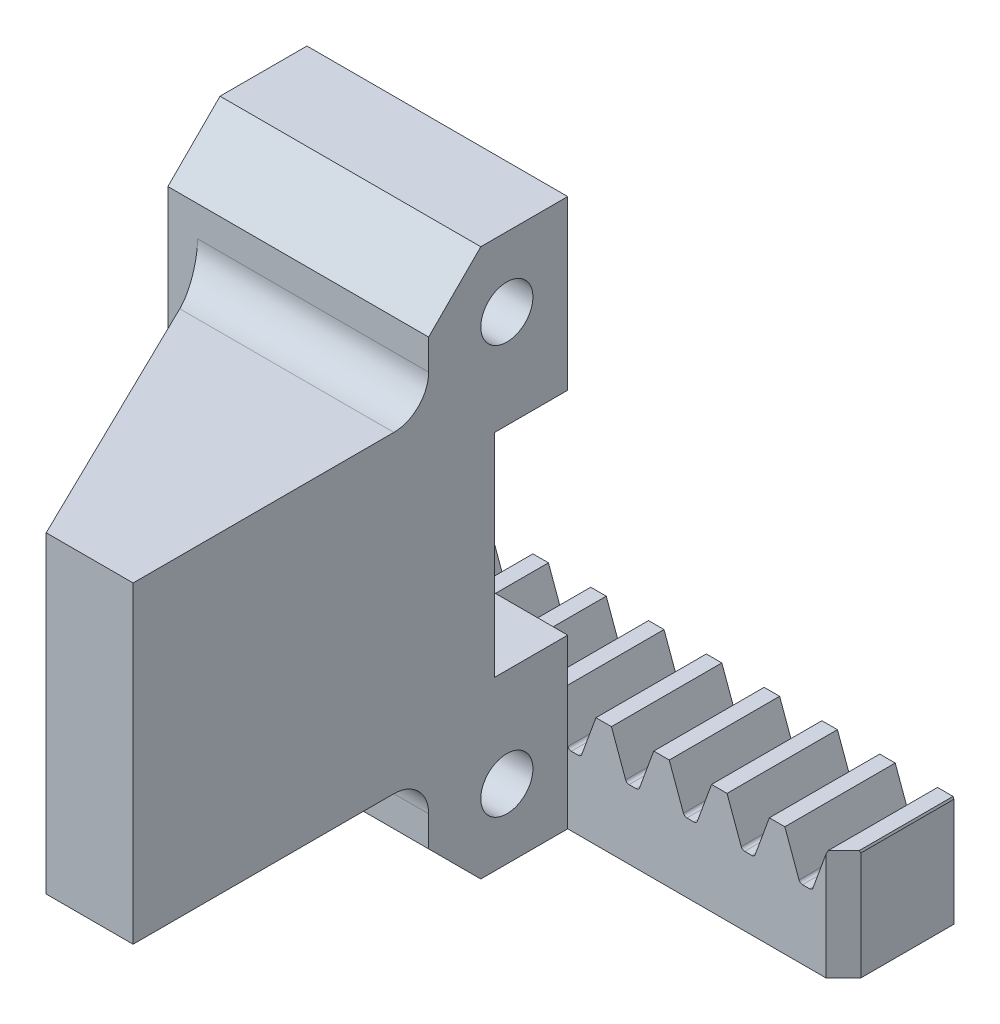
ISO-10303-21;
HEADER;
FILE_DESCRIPTION(('STEP AP214'),'2;1');
FILE_NAME('part.step','',(''),(''),'','','');
FILE_SCHEMA(('AUTOMOTIVE_DESIGN { 1 0 10303 214 1 1 1 1 }'));
ENDSEC;
DATA;
#1=APPLICATION_CONTEXT('core data for automotive mechanical design processes');
#2=APPLICATION_PROTOCOL_DEFINITION('international standard','automotive_design',2000,#1);
#3=PRODUCT_CONTEXT('',#1,'mechanical');
#4=PRODUCT('Part','Part','',(#3));
#5=PRODUCT_RELATED_PRODUCT_CATEGORY('part','',(#4));
#6=PRODUCT_DEFINITION_FORMATION('','',#4);
#7=PRODUCT_DEFINITION_CONTEXT('part definition',#1,'design');
#8=PRODUCT_DEFINITION('design','',#6,#7);
#9=PRODUCT_DEFINITION_SHAPE('','',#8);
#10=(LENGTH_UNIT() NAMED_UNIT(*) SI_UNIT(.MILLI.,.METRE.));
#11=(NAMED_UNIT(*) PLANE_ANGLE_UNIT() SI_UNIT($,.RADIAN.));
#12=(NAMED_UNIT(*) SI_UNIT($,.STERADIAN.) SOLID_ANGLE_UNIT());
#13=UNCERTAINTY_MEASURE_WITH_UNIT(LENGTH_MEASURE(1.E-05),#10,'distance_accuracy_value','');
#14=(GEOMETRIC_REPRESENTATION_CONTEXT(3) GLOBAL_UNCERTAINTY_ASSIGNED_CONTEXT((#13)) GLOBAL_UNIT_ASSIGNED_CONTEXT((#10,
#11,#12)) REPRESENTATION_CONTEXT('',''));
#15=CARTESIAN_POINT('',(0.,0.,0.));
#16=DIRECTION('',(0.,0.,1.));
#17=DIRECTION('',(1.,0.,0.));
#18=AXIS2_PLACEMENT_3D('',#15,#16,#17);
#19=CARTESIAN_POINT('',(-3.14424026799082,0.795866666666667,-3.175));
#20=DIRECTION('',(0.,1.,0.));
#21=DIRECTION('',(0.,0.,1.));
#22=AXIS2_PLACEMENT_3D('',#19,#20,#21);
#23=PLANE('',#22);
#24=DIRECTION('',(1.,0.,0.));
#25=VECTOR('',#24,1.);
#26=CARTESIAN_POINT('',(-3.14424026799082,0.795866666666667,-3.175));
#27=LINE('',#26,#25);
#28=CARTESIAN_POINT('',(-3.14424026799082,0.795866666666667,-3.175));
#29=VERTEX_POINT('',#28);
#30=CARTESIAN_POINT('',(-3.55071339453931,0.795866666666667,-3.175));
#31=VERTEX_POINT('',#30);
#32=EDGE_CURVE('E943',#29,#31,#27,.F.);
#33=ORIENTED_EDGE('',*,*,#32,.T.);
#34=DIRECTION('',(0.,0.,1.));
#35=VECTOR('',#34,1.);
#36=CARTESIAN_POINT('',(-3.55071339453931,0.795866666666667,-3.175));
#37=LINE('',#36,#35);
#38=CARTESIAN_POINT('',(-3.55071339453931,0.795866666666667,3.175));
#39=VERTEX_POINT('',#38);
#40=EDGE_CURVE('E948',#31,#39,#37,.T.);
#41=ORIENTED_EDGE('',*,*,#40,.T.);
#42=DIRECTION('',(1.,0.,0.));
#43=VECTOR('',#42,1.);
#44=CARTESIAN_POINT('',(-3.14424026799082,0.795866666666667,3.175));
#45=LINE('',#44,#43);
#46=CARTESIAN_POINT('',(-3.14424026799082,0.795866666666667,3.175));
#47=VERTEX_POINT('',#46);
#48=EDGE_CURVE('E952',#39,#47,#45,.T.);
#49=ORIENTED_EDGE('',*,*,#48,.T.);
#50=DIRECTION('',(0.,0.,1.));
#51=VECTOR('',#50,1.);
#52=CARTESIAN_POINT('',(-3.14424026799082,0.795866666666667,-3.175));
#53=LINE('',#52,#51);
#54=EDGE_CURVE('E844',#47,#29,#53,.F.);
#55=ORIENTED_EDGE('',*,*,#54,.T.);
#56=EDGE_LOOP('',(#33,#41,#49,#55));
#57=FACE_BOUND('',#56,.T.);
#58=ADVANCED_FACE('F18',(#57),#23,.T.);
#59=CARTESIAN_POINT('',(-6.46910026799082,0.795866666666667,-3.175));
#60=DIRECTION('',(0.,1.,0.));
#61=DIRECTION('',(-1.,0.,0.));
#62=AXIS2_PLACEMENT_3D('',#59,#60,#61);
#63=PLANE('',#62);
#64=DIRECTION('',(-1.,0.,0.));
#65=VECTOR('',#64,1.);
#66=CARTESIAN_POINT('',(-6.46910026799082,0.795866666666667,-3.175));
#67=LINE('',#66,#65);
#68=CARTESIAN_POINT('',(-6.46910026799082,0.795866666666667,-3.175));
#69=VERTEX_POINT('',#68);
#70=CARTESIAN_POINT('',(-6.87557339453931,0.795866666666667,-3.175));
#71=VERTEX_POINT('',#70);
#72=EDGE_CURVE('E932',#69,#71,#67,.T.);
#73=ORIENTED_EDGE('',*,*,#72,.T.);
#74=DIRECTION('',(0.,0.,1.));
#75=VECTOR('',#74,1.);
#76=CARTESIAN_POINT('',(-6.87557339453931,0.795866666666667,-3.175));
#77=LINE('',#76,#75);
#78=CARTESIAN_POINT('',(-6.87557339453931,0.795866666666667,3.175));
#79=VERTEX_POINT('',#78);
#80=EDGE_CURVE('E937',#71,#79,#77,.T.);
#81=ORIENTED_EDGE('',*,*,#80,.T.);
#82=DIRECTION('',(-1.,0.,0.));
#83=VECTOR('',#82,1.);
#84=CARTESIAN_POINT('',(-6.46910026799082,0.795866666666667,3.175));
#85=LINE('',#84,#83);
#86=CARTESIAN_POINT('',(-6.46910026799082,0.795866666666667,3.175));
#87=VERTEX_POINT('',#86);
#88=EDGE_CURVE('E941',#79,#87,#85,.F.);
#89=ORIENTED_EDGE('',*,*,#88,.T.);
#90=DIRECTION('',(0.,0.,1.));
#91=VECTOR('',#90,1.);
#92=CARTESIAN_POINT('',(-6.46910026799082,0.795866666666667,-3.175));
#93=LINE('',#92,#91);
#94=EDGE_CURVE('E835',#87,#69,#93,.F.);
#95=ORIENTED_EDGE('',*,*,#94,.T.);
#96=EDGE_LOOP('',(#73,#81,#89,#95));
#97=FACE_BOUND('',#96,.T.);
#98=ADVANCED_FACE('F2107',(#97),#63,.T.);
#99=CARTESIAN_POINT('',(-9.79396026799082,0.795866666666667,-3.175));
#100=DIRECTION('',(0.,1.,0.));
#101=DIRECTION('',(0.,0.,1.));
#102=AXIS2_PLACEMENT_3D('',#99,#100,#101);
#103=PLANE('',#102);
#104=DIRECTION('',(1.,0.,0.));
#105=VECTOR('',#104,1.);
#106=CARTESIAN_POINT('',(-9.79396026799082,0.795866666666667,-3.175));
#107=LINE('',#106,#105);
#108=CARTESIAN_POINT('',(-9.79396026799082,0.795866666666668,-3.175));
#109=VERTEX_POINT('',#108);
#110=CARTESIAN_POINT('',(-10.2004333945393,0.795866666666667,-3.175));
#111=VERTEX_POINT('',#110);
#112=EDGE_CURVE('E921',#109,#111,#107,.F.);
#113=ORIENTED_EDGE('',*,*,#112,.T.);
#114=DIRECTION('',(0.,0.,1.));
#115=VECTOR('',#114,1.);
#116=CARTESIAN_POINT('',(-10.2004333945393,0.795866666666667,-3.175));
#117=LINE('',#116,#115);
#118=CARTESIAN_POINT('',(-10.2004333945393,0.795866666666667,3.175));
#119=VERTEX_POINT('',#118);
#120=EDGE_CURVE('E926',#111,#119,#117,.T.);
#121=ORIENTED_EDGE('',*,*,#120,.T.);
#122=DIRECTION('',(1.,0.,0.));
#123=VECTOR('',#122,1.);
#124=CARTESIAN_POINT('',(-9.79396026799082,0.795866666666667,3.175));
#125=LINE('',#124,#123);
#126=CARTESIAN_POINT('',(-9.79396026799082,0.795866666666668,3.175));
#127=VERTEX_POINT('',#126);
#128=EDGE_CURVE('E930',#119,#127,#125,.T.);
#129=ORIENTED_EDGE('',*,*,#128,.T.);
#130=DIRECTION('',(0.,0.,1.));
#131=VECTOR('',#130,1.);
#132=CARTESIAN_POINT('',(-9.79396026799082,0.795866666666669,-3.175));
#133=LINE('',#132,#131);
#134=EDGE_CURVE('E825',#127,#109,#133,.F.);
#135=ORIENTED_EDGE('',*,*,#134,.T.);
#136=EDGE_LOOP('',(#113,#121,#129,#135));
#137=FACE_BOUND('',#136,.T.);
#138=ADVANCED_FACE('F2098',(#137),#103,.T.);
#139=CARTESIAN_POINT('',(-13.1188202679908,0.795866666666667,-3.175));
#140=DIRECTION('',(0.,1.,0.));
#141=DIRECTION('',(0.,0.,1.));
#142=AXIS2_PLACEMENT_3D('',#139,#140,#141);
#143=PLANE('',#142);
#144=DIRECTION('',(1.,0.,0.));
#145=VECTOR('',#144,1.);
#146=CARTESIAN_POINT('',(-13.1188202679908,0.795866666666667,-3.175));
#147=LINE('',#146,#145);
#148=CARTESIAN_POINT('',(-13.1188202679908,0.795866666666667,-3.175));
#149=VERTEX_POINT('',#148);
#150=CARTESIAN_POINT('',(-13.5252933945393,0.795866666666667,-3.175));
#151=VERTEX_POINT('',#150);
#152=EDGE_CURVE('E912',#149,#151,#147,.F.);
#153=ORIENTED_EDGE('',*,*,#152,.T.);
#154=DIRECTION('',(0.,0.,1.));
#155=VECTOR('',#154,1.);
#156=CARTESIAN_POINT('',(-13.5252933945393,0.795866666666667,-3.175));
#157=LINE('',#156,#155);
#158=CARTESIAN_POINT('',(-13.5252933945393,0.795866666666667,3.175));
#159=VERTEX_POINT('',#158);
#160=EDGE_CURVE('E915',#151,#159,#157,.T.);
#161=ORIENTED_EDGE('',*,*,#160,.T.);
#162=DIRECTION('',(1.,0.,0.));
#163=VECTOR('',#162,1.);
#164=CARTESIAN_POINT('',(-13.1188202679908,0.795866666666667,3.175));
#165=LINE('',#164,#163);
#166=CARTESIAN_POINT('',(-13.1188202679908,0.795866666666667,3.175));
#167=VERTEX_POINT('',#166);
#168=EDGE_CURVE('E919',#159,#167,#165,.T.);
#169=ORIENTED_EDGE('',*,*,#168,.T.);
#170=DIRECTION('',(0.,0.,1.));
#171=VECTOR('',#170,1.);
#172=CARTESIAN_POINT('',(-13.1188202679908,0.795866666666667,-3.175));
#173=LINE('',#172,#171);
#174=EDGE_CURVE('E815',#167,#149,#173,.F.);
#175=ORIENTED_EDGE('',*,*,#174,.T.);
#176=EDGE_LOOP('',(#153,#161,#169,#175));
#177=FACE_BOUND('',#176,.T.);
#178=ADVANCED_FACE('F2090',(#177),#143,.T.);
#179=CARTESIAN_POINT('',(0.180619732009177,0.795866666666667,-3.175));
#180=DIRECTION('',(0.,1.,0.));
#181=DIRECTION('',(0.,0.,1.));
#182=AXIS2_PLACEMENT_3D('',#179,#180,#181);
#183=PLANE('',#182);
#184=DIRECTION('',(1.,0.,0.));
#185=VECTOR('',#184,1.);
#186=CARTESIAN_POINT('',(0.180619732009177,0.795866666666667,-3.175));
#187=LINE('',#186,#185);
#188=CARTESIAN_POINT('',(0.180619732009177,0.795866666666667,-3.175));
#189=VERTEX_POINT('',#188);
#190=CARTESIAN_POINT('',(-0.225853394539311,0.795866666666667,-3.175));
#191=VERTEX_POINT('',#190);
#192=EDGE_CURVE('E899',#189,#191,#187,.F.);
#193=ORIENTED_EDGE('',*,*,#192,.T.);
#194=DIRECTION('',(0.,0.,1.));
#195=VECTOR('',#194,1.);
#196=CARTESIAN_POINT('',(-0.225853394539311,0.795866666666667,-3.175));
#197=LINE('',#196,#195);
#198=CARTESIAN_POINT('',(-0.225853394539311,0.795866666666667,3.175));
#199=VERTEX_POINT('',#198);
#200=EDGE_CURVE('E487',#191,#199,#197,.T.);
#201=ORIENTED_EDGE('',*,*,#200,.T.);
#202=DIRECTION('',(1.,0.,0.));
#203=VECTOR('',#202,1.);
#204=CARTESIAN_POINT('',(0.180619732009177,0.795866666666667,3.175));
#205=LINE('',#204,#203);
#206=CARTESIAN_POINT('',(0.180619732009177,0.795866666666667,3.175));
#207=VERTEX_POINT('',#206);
#208=EDGE_CURVE('E910',#199,#207,#205,.T.);
#209=ORIENTED_EDGE('',*,*,#208,.T.);
#210=DIRECTION('',(0.,0.,1.));
#211=VECTOR('',#210,1.);
#212=CARTESIAN_POINT('',(0.180619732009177,0.795866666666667,-3.175));
#213=LINE('',#212,#211);
#214=EDGE_CURVE('E905',#207,#189,#213,.F.);
#215=ORIENTED_EDGE('',*,*,#214,.T.);
#216=EDGE_LOOP('',(#193,#201,#209,#215));
#217=FACE_BOUND('',#216,.T.);
#218=ADVANCED_FACE('F1054',(#217),#183,.T.);
#219=CARTESIAN_POINT('',(3.50547973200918,0.795866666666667,-3.175));
#220=DIRECTION('',(0.,1.,0.));
#221=DIRECTION('',(0.,0.,1.));
#222=AXIS2_PLACEMENT_3D('',#219,#220,#221);
#223=PLANE('',#222);
#224=DIRECTION('',(1.,0.,0.));
#225=VECTOR('',#224,1.);
#226=CARTESIAN_POINT('',(3.50547973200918,0.795866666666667,-3.175));
#227=LINE('',#226,#225);
#228=CARTESIAN_POINT('',(3.50547973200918,0.795866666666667,-3.175));
#229=VERTEX_POINT('',#228);
#230=CARTESIAN_POINT('',(3.09900660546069,0.795866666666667,-3.175));
#231=VERTEX_POINT('',#230);
#232=EDGE_CURVE('E888',#229,#231,#227,.F.);
#233=ORIENTED_EDGE('',*,*,#232,.T.);
#234=DIRECTION('',(0.,0.,1.));
#235=VECTOR('',#234,1.);
#236=CARTESIAN_POINT('',(3.09900660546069,0.795866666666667,-3.175));
#237=LINE('',#236,#235);
#238=CARTESIAN_POINT('',(3.09900660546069,0.795866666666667,3.175));
#239=VERTEX_POINT('',#238);
#240=EDGE_CURVE('E901',#231,#239,#237,.T.);
#241=ORIENTED_EDGE('',*,*,#240,.T.);
#242=DIRECTION('',(1.,0.,0.));
#243=VECTOR('',#242,1.);
#244=CARTESIAN_POINT('',(3.50547973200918,0.795866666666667,3.175));
#245=LINE('',#244,#243);
#246=CARTESIAN_POINT('',(3.50547973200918,0.795866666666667,3.175));
#247=VERTEX_POINT('',#246);
#248=EDGE_CURVE('E897',#239,#247,#245,.T.);
#249=ORIENTED_EDGE('',*,*,#248,.T.);
#250=DIRECTION('',(0.,0.,1.));
#251=VECTOR('',#250,1.);
#252=CARTESIAN_POINT('',(3.50547973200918,0.795866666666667,-3.175));
#253=LINE('',#252,#251);
#254=EDGE_CURVE('E800',#247,#229,#253,.F.);
#255=ORIENTED_EDGE('',*,*,#254,.T.);
#256=EDGE_LOOP('',(#233,#241,#249,#255));
#257=FACE_BOUND('',#256,.T.);
#258=ADVANCED_FACE('F2073',(#257),#223,.T.);
#259=CARTESIAN_POINT('',(6.83033973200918,0.795866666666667,-3.175));
#260=DIRECTION('',(0.,1.,0.));
#261=DIRECTION('',(0.,0.,1.));
#262=AXIS2_PLACEMENT_3D('',#259,#260,#261);
#263=PLANE('',#262);
#264=DIRECTION('',(1.,0.,0.));
#265=VECTOR('',#264,1.);
#266=CARTESIAN_POINT('',(6.83033973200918,0.795866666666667,-3.175));
#267=LINE('',#266,#265);
#268=CARTESIAN_POINT('',(6.83033973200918,0.795866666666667,-3.175));
#269=VERTEX_POINT('',#268);
#270=CARTESIAN_POINT('',(6.42386660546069,0.795866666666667,-3.175));
#271=VERTEX_POINT('',#270);
#272=EDGE_CURVE('E877',#269,#271,#267,.F.);
#273=ORIENTED_EDGE('',*,*,#272,.T.);
#274=DIRECTION('',(0.,0.,1.));
#275=VECTOR('',#274,1.);
#276=CARTESIAN_POINT('',(6.42386660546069,0.795866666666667,-3.175));
#277=LINE('',#276,#275);
#278=CARTESIAN_POINT('',(6.42386660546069,0.795866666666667,3.175));
#279=VERTEX_POINT('',#278);
#280=EDGE_CURVE('E890',#271,#279,#277,.T.);
#281=ORIENTED_EDGE('',*,*,#280,.T.);
#282=DIRECTION('',(1.,0.,0.));
#283=VECTOR('',#282,1.);
#284=CARTESIAN_POINT('',(6.83033973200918,0.795866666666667,3.175));
#285=LINE('',#284,#283);
#286=CARTESIAN_POINT('',(6.83033973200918,0.795866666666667,3.175));
#287=VERTEX_POINT('',#286);
#288=EDGE_CURVE('E886',#279,#287,#285,.T.);
#289=ORIENTED_EDGE('',*,*,#288,.T.);
#290=DIRECTION('',(0.,0.,1.));
#291=VECTOR('',#290,1.);
#292=CARTESIAN_POINT('',(6.83033973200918,0.795866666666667,-3.175));
#293=LINE('',#292,#291);
#294=EDGE_CURVE('E790',#287,#269,#293,.F.);
#295=ORIENTED_EDGE('',*,*,#294,.T.);
#296=EDGE_LOOP('',(#273,#281,#289,#295));
#297=FACE_BOUND('',#296,.T.);
#298=ADVANCED_FACE('F2064',(#297),#263,.T.);
#299=CARTESIAN_POINT('',(10.1551997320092,0.795866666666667,-3.175));
#300=DIRECTION('',(0.,1.,0.));
#301=DIRECTION('',(-1.,0.,0.));
#302=AXIS2_PLACEMENT_3D('',#299,#300,#301);
#303=PLANE('',#302);
#304=DIRECTION('',(-1.,0.,0.));
#305=VECTOR('',#304,1.);
#306=CARTESIAN_POINT('',(10.1551997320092,0.795866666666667,-3.175));
#307=LINE('',#306,#305);
#308=CARTESIAN_POINT('',(10.1551997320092,0.795866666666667,-3.175));
#309=VERTEX_POINT('',#308);
#310=CARTESIAN_POINT('',(9.74872660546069,0.795866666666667,-3.175));
#311=VERTEX_POINT('',#310);
#312=EDGE_CURVE('E852',#309,#311,#307,.T.);
#313=ORIENTED_EDGE('',*,*,#312,.T.);
#314=DIRECTION('',(0.,0.,1.));
#315=VECTOR('',#314,1.);
#316=CARTESIAN_POINT('',(9.74872660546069,0.795866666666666,-3.175));
#317=LINE('',#316,#315);
#318=CARTESIAN_POINT('',(9.74872660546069,0.795866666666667,3.175));
#319=VERTEX_POINT('',#318);
#320=EDGE_CURVE('E879',#311,#319,#317,.T.);
#321=ORIENTED_EDGE('',*,*,#320,.T.);
#322=DIRECTION('',(-1.,0.,0.));
#323=VECTOR('',#322,1.);
#324=CARTESIAN_POINT('',(10.1551997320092,0.795866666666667,3.175));
#325=LINE('',#324,#323);
#326=CARTESIAN_POINT('',(10.1551997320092,0.795866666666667,3.175));
#327=VERTEX_POINT('',#326);
#328=EDGE_CURVE('E875',#319,#327,#325,.F.);
#329=ORIENTED_EDGE('',*,*,#328,.T.);
#330=DIRECTION('',(0.,0.,1.));
#331=VECTOR('',#330,1.);
#332=CARTESIAN_POINT('',(10.1551997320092,0.795866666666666,-3.175));
#333=LINE('',#332,#331);
#334=EDGE_CURVE('E780',#327,#309,#333,.F.);
#335=ORIENTED_EDGE('',*,*,#334,.T.);
#336=EDGE_LOOP('',(#313,#321,#329,#335));
#337=FACE_BOUND('',#336,.T.);
#338=ADVANCED_FACE('F2055',(#337),#303,.T.);
#339=CARTESIAN_POINT('',(13.4800597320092,0.795866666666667,-3.175));
#340=DIRECTION('',(0.,1.,0.));
#341=DIRECTION('',(-1.,0.,0.));
#342=AXIS2_PLACEMENT_3D('',#339,#340,#341);
#343=PLANE('',#342);
#344=DIRECTION('',(-1.,0.,0.));
#345=VECTOR('',#344,1.);
#346=CARTESIAN_POINT('',(13.4800597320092,0.795866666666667,-3.175));
#347=LINE('',#346,#345);
#348=CARTESIAN_POINT('',(13.4800597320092,0.795866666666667,-3.175));
#349=VERTEX_POINT('',#348);
#350=CARTESIAN_POINT('',(13.0735866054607,0.795866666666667,-3.175));
#351=VERTEX_POINT('',#350);
#352=EDGE_CURVE('E490',#349,#351,#347,.T.);
#353=ORIENTED_EDGE('',*,*,#352,.T.);
#354=DIRECTION('',(0.,0.,1.));
#355=VECTOR('',#354,1.);
#356=CARTESIAN_POINT('',(13.0735866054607,0.795866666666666,-3.175));
#357=LINE('',#356,#355);
#358=CARTESIAN_POINT('',(13.0735866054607,0.795866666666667,3.175));
#359=VERTEX_POINT('',#358);
#360=EDGE_CURVE('E868',#351,#359,#357,.T.);
#361=ORIENTED_EDGE('',*,*,#360,.T.);
#362=DIRECTION('',(-1.,0.,0.));
#363=VECTOR('',#362,1.);
#364=CARTESIAN_POINT('',(13.4800597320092,0.795866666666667,3.175));
#365=LINE('',#364,#363);
#366=CARTESIAN_POINT('',(13.4800597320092,0.795866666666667,3.175));
#367=VERTEX_POINT('',#366);
#368=EDGE_CURVE('E850',#359,#367,#365,.F.);
#369=ORIENTED_EDGE('',*,*,#368,.T.);
#370=DIRECTION('',(0.,0.,1.));
#371=VECTOR('',#370,1.);
#372=CARTESIAN_POINT('',(13.4800597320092,0.795866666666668,-3.175));
#373=LINE('',#372,#371);
#374=EDGE_CURVE('E767',#367,#349,#373,.F.);
#375=ORIENTED_EDGE('',*,*,#374,.T.);
#376=EDGE_LOOP('',(#353,#361,#369,#375));
#377=FACE_BOUND('',#376,.T.);
#378=ADVANCED_FACE('F2047',(#377),#343,.T.);
#379=CARTESIAN_POINT('',(-0.225853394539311,1.00615653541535,-3.175));
#380=DIRECTION('',(0.,0.,1.));
#381=DIRECTION('',(1.,0.,0.));
#382=AXIS2_PLACEMENT_3D('',#379,#380,#381);
#383=CYLINDRICAL_SURFACE('',#382,0.210289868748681);
#384=ORIENTED_EDGE('',*,*,#200,.F.);
#385=CARTESIAN_POINT('',(-0.225853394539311,1.00615653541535,-3.175));
#386=DIRECTION('',(0.,0.,1.));
#387=DIRECTION('',(1.,0.,0.));
#388=AXIS2_PLACEMENT_3D('',#385,#386,#387);
#389=CIRCLE('',#388,0.210289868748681);
#390=CARTESIAN_POINT('',(-0.423461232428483,0.934233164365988,-3.175));
#391=VERTEX_POINT('',#390);
#392=EDGE_CURVE('E21',#391,#191,#389,.T.);
#393=ORIENTED_EDGE('',*,*,#392,.F.);
#394=DIRECTION('',(0.,0.,1.));
#395=VECTOR('',#394,1.);
#396=CARTESIAN_POINT('',(-0.423461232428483,0.934233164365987,-3.175));
#397=LINE('',#396,#395);
#398=CARTESIAN_POINT('',(-0.423461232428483,0.934233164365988,3.175));
#399=VERTEX_POINT('',#398);
#400=EDGE_CURVE('E485',#399,#391,#397,.F.);
#401=ORIENTED_EDGE('',*,*,#400,.F.);
#402=CARTESIAN_POINT('',(-0.225853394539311,1.00615653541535,3.175));
#403=DIRECTION('',(0.,0.,1.));
#404=DIRECTION('',(1.,0.,0.));
#405=AXIS2_PLACEMENT_3D('',#402,#403,#404);
#406=CIRCLE('',#405,0.210289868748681);
#407=EDGE_CURVE('E840',#199,#399,#406,.F.);
#408=ORIENTED_EDGE('',*,*,#407,.F.);
#409=EDGE_LOOP('',(#384,#393,#401,#408));
#410=FACE_BOUND('',#409,.T.);
#411=ADVANCED_FACE('F483',(#410),#383,.F.);
#412=CARTESIAN_POINT('',(-1.23903366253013,3.175,-3.175));
#413=DIRECTION('',(0.,1.,0.));
#414=DIRECTION('',(0.,0.,1.));
#415=AXIS2_PLACEMENT_3D('',#412,#413,#414);
#416=PLANE('',#415);
#417=DIRECTION('',(1.,0.,0.));
#418=VECTOR('',#417,1.);
#419=CARTESIAN_POINT('',(-1.23903366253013,3.175,-3.175));
#420=LINE('',#419,#418);
#421=CARTESIAN_POINT('',(-1.23903366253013,3.175,-3.175));
#422=VERTEX_POINT('',#421);
#423=CARTESIAN_POINT('',(-2.13106,3.175,-3.175));
#424=VERTEX_POINT('',#423);
#425=EDGE_CURVE('E503',#422,#424,#420,.F.);
#426=ORIENTED_EDGE('',*,*,#425,.T.);
#427=DIRECTION('',(0.,0.,1.));
#428=VECTOR('',#427,1.);
#429=CARTESIAN_POINT('',(-2.13106,3.175,-3.175));
#430=LINE('',#429,#428);
#431=CARTESIAN_POINT('',(-2.13106,3.175,3.175));
#432=VERTEX_POINT('',#431);
#433=EDGE_CURVE('E717',#432,#424,#430,.F.);
#434=ORIENTED_EDGE('',*,*,#433,.F.);
#435=DIRECTION('',(1.,0.,0.));
#436=VECTOR('',#435,1.);
#437=CARTESIAN_POINT('',(-1.23903366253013,3.175,3.175));
#438=LINE('',#437,#436);
#439=CARTESIAN_POINT('',(-1.23903366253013,3.175,3.175));
#440=VERTEX_POINT('',#439);
#441=EDGE_CURVE('E838',#432,#440,#438,.T.);
#442=ORIENTED_EDGE('',*,*,#441,.T.);
#443=DIRECTION('',(0.,0.,1.));
#444=VECTOR('',#443,1.);
#445=CARTESIAN_POINT('',(-1.23903366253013,3.175,-3.175));
#446=LINE('',#445,#444);
#447=EDGE_CURVE('E499',#422,#440,#446,.T.);
#448=ORIENTED_EDGE('',*,*,#447,.F.);
#449=EDGE_LOOP('',(#426,#434,#442,#448));
#450=FACE_BOUND('',#449,.T.);
#451=ADVANCED_FACE('F2030',(#450),#416,.T.);
#452=CARTESIAN_POINT('',(-3.14424026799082,1.00615653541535,-3.175));
#453=DIRECTION('',(0.,0.,1.));
#454=DIRECTION('',(1.,0.,0.));
#455=AXIS2_PLACEMENT_3D('',#452,#453,#454);
#456=CYLINDRICAL_SURFACE('',#455,0.21028986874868);
#457=DIRECTION('',(0.,0.,1.));
#458=VECTOR('',#457,1.);
#459=CARTESIAN_POINT('',(-2.94663243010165,0.934233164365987,-3.175));
#460=LINE('',#459,#458);
#461=CARTESIAN_POINT('',(-2.94663243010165,0.934233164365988,-3.175));
#462=VERTEX_POINT('',#461);
#463=CARTESIAN_POINT('',(-2.94663243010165,0.934233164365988,3.175));
#464=VERTEX_POINT('',#463);
#465=EDGE_CURVE('E710',#462,#464,#460,.T.);
#466=ORIENTED_EDGE('',*,*,#465,.F.);
#467=CARTESIAN_POINT('',(-3.14424026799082,1.00615653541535,-3.175));
#468=DIRECTION('',(0.,0.,1.));
#469=DIRECTION('',(1.,0.,0.));
#470=AXIS2_PLACEMENT_3D('',#467,#468,#469);
#471=CIRCLE('',#470,0.21028986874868);
#472=EDGE_CURVE('E957',#29,#462,#471,.T.);
#473=ORIENTED_EDGE('',*,*,#472,.F.);
#474=ORIENTED_EDGE('',*,*,#54,.F.);
#475=CARTESIAN_POINT('',(-3.14424026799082,1.00615653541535,3.175));
#476=DIRECTION('',(0.,0.,1.));
#477=DIRECTION('',(1.,0.,0.));
#478=AXIS2_PLACEMENT_3D('',#475,#476,#477);
#479=CIRCLE('',#478,0.21028986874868);
#480=EDGE_CURVE('E1046',#464,#47,#479,.F.);
#481=ORIENTED_EDGE('',*,*,#480,.F.);
#482=EDGE_LOOP('',(#466,#473,#474,#481));
#483=FACE_BOUND('',#482,.T.);
#484=ADVANCED_FACE('F2021',(#483),#456,.F.);
#485=CARTESIAN_POINT('',(-3.55071339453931,1.00615653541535,-3.175));
#486=DIRECTION('',(0.,0.,1.));
#487=DIRECTION('',(1.,0.,0.));
#488=AXIS2_PLACEMENT_3D('',#485,#486,#487);
#489=CYLINDRICAL_SURFACE('',#488,0.21028986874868);
#490=ORIENTED_EDGE('',*,*,#40,.F.);
#491=CARTESIAN_POINT('',(-3.55071339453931,1.00615653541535,-3.175));
#492=DIRECTION('',(0.,0.,1.));
#493=DIRECTION('',(1.,0.,0.));
#494=AXIS2_PLACEMENT_3D('',#491,#492,#493);
#495=CIRCLE('',#494,0.21028986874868);
#496=CARTESIAN_POINT('',(-3.74832123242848,0.934233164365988,-3.175));
#497=VERTEX_POINT('',#496);
#498=EDGE_CURVE('E951',#497,#31,#495,.T.);
#499=ORIENTED_EDGE('',*,*,#498,.F.);
#500=DIRECTION('',(0.,0.,1.));
#501=VECTOR('',#500,1.);
#502=CARTESIAN_POINT('',(-3.74832123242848,0.934233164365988,-3.175));
#503=LINE('',#502,#501);
#504=CARTESIAN_POINT('',(-3.74832123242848,0.934233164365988,3.175));
#505=VERTEX_POINT('',#504);
#506=EDGE_CURVE('E707',#505,#497,#503,.F.);
#507=ORIENTED_EDGE('',*,*,#506,.F.);
#508=CARTESIAN_POINT('',(-3.55071339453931,1.00615653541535,3.175));
#509=DIRECTION('',(0.,0.,1.));
#510=DIRECTION('',(1.,0.,0.));
#511=AXIS2_PLACEMENT_3D('',#508,#509,#510);
#512=CIRCLE('',#511,0.21028986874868);
#513=EDGE_CURVE('E831',#39,#505,#512,.F.);
#514=ORIENTED_EDGE('',*,*,#513,.F.);
#515=EDGE_LOOP('',(#490,#499,#507,#514));
#516=FACE_BOUND('',#515,.T.);
#517=ADVANCED_FACE('F2012',(#516),#489,.F.);
#518=CARTESIAN_POINT('',(-4.56389366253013,3.175,-3.175));
#519=DIRECTION('',(0.,1.,0.));
#520=DIRECTION('',(-1.,0.,0.));
#521=AXIS2_PLACEMENT_3D('',#518,#519,#520);
#522=PLANE('',#521);
#523=DIRECTION('',(-1.,0.,0.));
#524=VECTOR('',#523,1.);
#525=CARTESIAN_POINT('',(-4.56389366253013,3.175,-3.175));
#526=LINE('',#525,#524);
#527=CARTESIAN_POINT('',(-4.56389366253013,3.175,-3.175));
#528=VERTEX_POINT('',#527);
#529=CARTESIAN_POINT('',(-5.45592,3.175,-3.175));
#530=VERTEX_POINT('',#529);
#531=EDGE_CURVE('E830',#528,#530,#526,.T.);
#532=ORIENTED_EDGE('',*,*,#531,.T.);
#533=DIRECTION('',(0.,0.,1.));
#534=VECTOR('',#533,1.);
#535=CARTESIAN_POINT('',(-5.45592,3.175,-3.175));
#536=LINE('',#535,#534);
#537=CARTESIAN_POINT('',(-5.45592,3.175,3.175));
#538=VERTEX_POINT('',#537);
#539=EDGE_CURVE('E701',#538,#530,#536,.F.);
#540=ORIENTED_EDGE('',*,*,#539,.F.);
#541=DIRECTION('',(-1.,0.,0.));
#542=VECTOR('',#541,1.);
#543=CARTESIAN_POINT('',(-4.56389366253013,3.175,3.175));
#544=LINE('',#543,#542);
#545=CARTESIAN_POINT('',(-4.56389366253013,3.175,3.175));
#546=VERTEX_POINT('',#545);
#547=EDGE_CURVE('E828',#538,#546,#544,.F.);
#548=ORIENTED_EDGE('',*,*,#547,.T.);
#549=DIRECTION('',(0.,0.,1.));
#550=VECTOR('',#549,1.);
#551=CARTESIAN_POINT('',(-4.56389366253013,3.175,-3.175));
#552=LINE('',#551,#550);
#553=EDGE_CURVE('E704',#528,#546,#552,.T.);
#554=ORIENTED_EDGE('',*,*,#553,.F.);
#555=EDGE_LOOP('',(#532,#540,#548,#554));
#556=FACE_BOUND('',#555,.T.);
#557=ADVANCED_FACE('F2003',(#556),#522,.T.);
#558=CARTESIAN_POINT('',(-6.46910026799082,1.00615653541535,-3.175));
#559=DIRECTION('',(0.,0.,1.));
#560=DIRECTION('',(1.,0.,0.));
#561=AXIS2_PLACEMENT_3D('',#558,#559,#560);
#562=CYLINDRICAL_SURFACE('',#561,0.210289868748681);
#563=DIRECTION('',(0.,0.,1.));
#564=VECTOR('',#563,1.);
#565=CARTESIAN_POINT('',(-6.27149243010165,0.934233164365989,-3.175));
#566=LINE('',#565,#564);
#567=CARTESIAN_POINT('',(-6.27149243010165,0.934233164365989,-3.175));
#568=VERTEX_POINT('',#567);
#569=CARTESIAN_POINT('',(-6.27149243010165,0.934233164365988,3.175));
#570=VERTEX_POINT('',#569);
#571=EDGE_CURVE('E694',#568,#570,#566,.T.);
#572=ORIENTED_EDGE('',*,*,#571,.F.);
#573=CARTESIAN_POINT('',(-6.46910026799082,1.00615653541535,-3.175));
#574=DIRECTION('',(0.,0.,1.));
#575=DIRECTION('',(1.,0.,0.));
#576=AXIS2_PLACEMENT_3D('',#573,#574,#575);
#577=CIRCLE('',#576,0.210289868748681);
#578=EDGE_CURVE('E947',#69,#568,#577,.T.);
#579=ORIENTED_EDGE('',*,*,#578,.F.);
#580=ORIENTED_EDGE('',*,*,#94,.F.);
#581=CARTESIAN_POINT('',(-6.46910026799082,1.00615653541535,3.175));
#582=DIRECTION('',(0.,0.,1.));
#583=DIRECTION('',(1.,0.,0.));
#584=AXIS2_PLACEMENT_3D('',#581,#582,#583);
#585=CIRCLE('',#584,0.210289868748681);
#586=EDGE_CURVE('E1039',#570,#87,#585,.F.);
#587=ORIENTED_EDGE('',*,*,#586,.F.);
#588=EDGE_LOOP('',(#572,#579,#580,#587));
#589=FACE_BOUND('',#588,.T.);
#590=ADVANCED_FACE('F1994',(#589),#562,.F.);
#591=CARTESIAN_POINT('',(-6.87557339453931,1.00615653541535,-3.175));
#592=DIRECTION('',(0.,0.,1.));
#593=DIRECTION('',(1.,0.,0.));
#594=AXIS2_PLACEMENT_3D('',#591,#592,#593);
#595=CYLINDRICAL_SURFACE('',#594,0.210289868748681);
#596=ORIENTED_EDGE('',*,*,#80,.F.);
#597=CARTESIAN_POINT('',(-6.87557339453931,1.00615653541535,-3.175));
#598=DIRECTION('',(0.,0.,1.));
#599=DIRECTION('',(1.,0.,0.));
#600=AXIS2_PLACEMENT_3D('',#597,#598,#599);
#601=CIRCLE('',#600,0.210289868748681);
#602=CARTESIAN_POINT('',(-7.07318123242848,0.934233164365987,-3.175));
#603=VERTEX_POINT('',#602);
#604=EDGE_CURVE('E940',#603,#71,#601,.T.);
#605=ORIENTED_EDGE('',*,*,#604,.F.);
#606=DIRECTION('',(0.,0.,1.));
#607=VECTOR('',#606,1.);
#608=CARTESIAN_POINT('',(-7.07318123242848,0.934233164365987,-3.175));
#609=LINE('',#608,#607);
#610=CARTESIAN_POINT('',(-7.07318123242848,0.934233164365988,3.175));
#611=VERTEX_POINT('',#610);
#612=EDGE_CURVE('E691',#611,#603,#609,.F.);
#613=ORIENTED_EDGE('',*,*,#612,.F.);
#614=CARTESIAN_POINT('',(-6.87557339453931,1.00615653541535,3.175));
#615=DIRECTION('',(0.,0.,1.));
#616=DIRECTION('',(1.,0.,0.));
#617=AXIS2_PLACEMENT_3D('',#614,#615,#616);
#618=CIRCLE('',#617,0.210289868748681);
#619=EDGE_CURVE('E821',#79,#611,#618,.F.);
#620=ORIENTED_EDGE('',*,*,#619,.F.);
#621=EDGE_LOOP('',(#596,#605,#613,#620));
#622=FACE_BOUND('',#621,.T.);
#623=ADVANCED_FACE('F1985',(#622),#595,.F.);
#624=CARTESIAN_POINT('',(-7.88875366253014,3.175,-3.175));
#625=DIRECTION('',(0.,1.,0.));
#626=DIRECTION('',(-1.,0.,0.));
#627=AXIS2_PLACEMENT_3D('',#624,#625,#626);
#628=PLANE('',#627);
#629=DIRECTION('',(-1.,0.,0.));
#630=VECTOR('',#629,1.);
#631=CARTESIAN_POINT('',(-7.88875366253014,3.175,-3.175));
#632=LINE('',#631,#630);
#633=CARTESIAN_POINT('',(-7.88875366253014,3.175,-3.175));
#634=VERTEX_POINT('',#633);
#635=CARTESIAN_POINT('',(-8.78078,3.175,-3.175));
#636=VERTEX_POINT('',#635);
#637=EDGE_CURVE('E820',#634,#636,#632,.T.);
#638=ORIENTED_EDGE('',*,*,#637,.T.);
#639=DIRECTION('',(0.,0.,1.));
#640=VECTOR('',#639,1.);
#641=CARTESIAN_POINT('',(-8.78078,3.175,-3.175));
#642=LINE('',#641,#640);
#643=CARTESIAN_POINT('',(-8.78078,3.175,3.175));
#644=VERTEX_POINT('',#643);
#645=EDGE_CURVE('E685',#644,#636,#642,.F.);
#646=ORIENTED_EDGE('',*,*,#645,.F.);
#647=DIRECTION('',(-1.,0.,0.));
#648=VECTOR('',#647,1.);
#649=CARTESIAN_POINT('',(-7.88875366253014,3.175,3.175));
#650=LINE('',#649,#648);
#651=CARTESIAN_POINT('',(-7.88875366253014,3.175,3.175));
#652=VERTEX_POINT('',#651);
#653=EDGE_CURVE('E818',#644,#652,#650,.F.);
#654=ORIENTED_EDGE('',*,*,#653,.T.);
#655=DIRECTION('',(0.,0.,1.));
#656=VECTOR('',#655,1.);
#657=CARTESIAN_POINT('',(-7.88875366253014,3.175,-3.175));
#658=LINE('',#657,#656);
#659=EDGE_CURVE('E688',#634,#652,#658,.T.);
#660=ORIENTED_EDGE('',*,*,#659,.F.);
#661=EDGE_LOOP('',(#638,#646,#654,#660));
#662=FACE_BOUND('',#661,.T.);
#663=ADVANCED_FACE('F1976',(#662),#628,.T.);
#664=CARTESIAN_POINT('',(-9.79396026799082,1.00615653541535,-3.175));
#665=DIRECTION('',(0.,0.,1.));
#666=DIRECTION('',(1.,0.,0.));
#667=AXIS2_PLACEMENT_3D('',#664,#665,#666);
#668=CYLINDRICAL_SURFACE('',#667,0.21028986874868);
#669=DIRECTION('',(0.,0.,1.));
#670=VECTOR('',#669,1.);
#671=CARTESIAN_POINT('',(-9.59635243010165,0.934233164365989,-3.175));
#672=LINE('',#671,#670);
#673=CARTESIAN_POINT('',(-9.59635243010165,0.934233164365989,-3.175));
#674=VERTEX_POINT('',#673);
#675=CARTESIAN_POINT('',(-9.59635243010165,0.934233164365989,3.175));
#676=VERTEX_POINT('',#675);
#677=EDGE_CURVE('E678',#674,#676,#672,.T.);
#678=ORIENTED_EDGE('',*,*,#677,.F.);
#679=CARTESIAN_POINT('',(-9.79396026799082,1.00615653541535,-3.175));
#680=DIRECTION('',(0.,0.,1.));
#681=DIRECTION('',(1.,0.,0.));
#682=AXIS2_PLACEMENT_3D('',#679,#680,#681);
#683=CIRCLE('',#682,0.21028986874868);
#684=EDGE_CURVE('E936',#109,#674,#683,.T.);
#685=ORIENTED_EDGE('',*,*,#684,.F.);
#686=ORIENTED_EDGE('',*,*,#134,.F.);
#687=CARTESIAN_POINT('',(-9.79396026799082,1.00615653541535,3.175));
#688=DIRECTION('',(0.,0.,1.));
#689=DIRECTION('',(1.,0.,0.));
#690=AXIS2_PLACEMENT_3D('',#687,#688,#689);
#691=CIRCLE('',#690,0.21028986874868);
#692=EDGE_CURVE('E1032',#676,#127,#691,.F.);
#693=ORIENTED_EDGE('',*,*,#692,.F.);
#694=EDGE_LOOP('',(#678,#685,#686,#693));
#695=FACE_BOUND('',#694,.T.);
#696=ADVANCED_FACE('F1967',(#695),#668,.F.);
#697=CARTESIAN_POINT('',(-10.2004333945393,1.00615653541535,-3.175));
#698=DIRECTION('',(0.,0.,1.));
#699=DIRECTION('',(1.,0.,0.));
#700=AXIS2_PLACEMENT_3D('',#697,#698,#699);
#701=CYLINDRICAL_SURFACE('',#700,0.210289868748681);
#702=ORIENTED_EDGE('',*,*,#120,.F.);
#703=CARTESIAN_POINT('',(-10.2004333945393,1.00615653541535,-3.175));
#704=DIRECTION('',(0.,0.,1.));
#705=DIRECTION('',(1.,0.,0.));
#706=AXIS2_PLACEMENT_3D('',#703,#704,#705);
#707=CIRCLE('',#706,0.210289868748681);
#708=CARTESIAN_POINT('',(-10.3980412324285,0.934233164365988,-3.175));
#709=VERTEX_POINT('',#708);
#710=EDGE_CURVE('E929',#709,#111,#707,.T.);
#711=ORIENTED_EDGE('',*,*,#710,.F.);
#712=DIRECTION('',(0.,0.,1.));
#713=VECTOR('',#712,1.);
#714=CARTESIAN_POINT('',(-10.3980412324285,0.934233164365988,-3.175));
#715=LINE('',#714,#713);
#716=CARTESIAN_POINT('',(-10.3980412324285,0.934233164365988,3.175));
#717=VERTEX_POINT('',#716);
#718=EDGE_CURVE('E675',#717,#709,#715,.F.);
#719=ORIENTED_EDGE('',*,*,#718,.F.);
#720=CARTESIAN_POINT('',(-10.2004333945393,1.00615653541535,3.175));
#721=DIRECTION('',(0.,0.,1.));
#722=DIRECTION('',(1.,0.,0.));
#723=AXIS2_PLACEMENT_3D('',#720,#721,#722);
#724=CIRCLE('',#723,0.210289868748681);
#725=EDGE_CURVE('E811',#119,#717,#724,.F.);
#726=ORIENTED_EDGE('',*,*,#725,.F.);
#727=EDGE_LOOP('',(#702,#711,#719,#726));
#728=FACE_BOUND('',#727,.T.);
#729=ADVANCED_FACE('F1958',(#728),#701,.F.);
#730=CARTESIAN_POINT('',(-11.2136136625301,3.175,-3.175));
#731=DIRECTION('',(0.,1.,0.));
#732=DIRECTION('',(-1.,0.,0.));
#733=AXIS2_PLACEMENT_3D('',#730,#731,#732);
#734=PLANE('',#733);
#735=DIRECTION('',(-1.,0.,0.));
#736=VECTOR('',#735,1.);
#737=CARTESIAN_POINT('',(-11.2136136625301,3.175,-3.175));
#738=LINE('',#737,#736);
#739=CARTESIAN_POINT('',(-11.2136136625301,3.175,-3.175));
#740=VERTEX_POINT('',#739);
#741=CARTESIAN_POINT('',(-12.10564,3.175,-3.175));
#742=VERTEX_POINT('',#741);
#743=EDGE_CURVE('E810',#740,#742,#738,.T.);
#744=ORIENTED_EDGE('',*,*,#743,.T.);
#745=DIRECTION('',(0.,0.,1.));
#746=VECTOR('',#745,1.);
#747=CARTESIAN_POINT('',(-12.10564,3.175,-3.175));
#748=LINE('',#747,#746);
#749=CARTESIAN_POINT('',(-12.10564,3.175,3.175));
#750=VERTEX_POINT('',#749);
#751=EDGE_CURVE('E669',#750,#742,#748,.F.);
#752=ORIENTED_EDGE('',*,*,#751,.F.);
#753=DIRECTION('',(-1.,0.,0.));
#754=VECTOR('',#753,1.);
#755=CARTESIAN_POINT('',(-11.2136136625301,3.175,3.175));
#756=LINE('',#755,#754);
#757=CARTESIAN_POINT('',(-11.2136136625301,3.175,3.175));
#758=VERTEX_POINT('',#757);
#759=EDGE_CURVE('E808',#750,#758,#756,.F.);
#760=ORIENTED_EDGE('',*,*,#759,.T.);
#761=DIRECTION('',(0.,0.,1.));
#762=VECTOR('',#761,1.);
#763=CARTESIAN_POINT('',(-11.2136136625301,3.175,-3.175));
#764=LINE('',#763,#762);
#765=EDGE_CURVE('E672',#740,#758,#764,.T.);
#766=ORIENTED_EDGE('',*,*,#765,.F.);
#767=EDGE_LOOP('',(#744,#752,#760,#766));
#768=FACE_BOUND('',#767,.T.);
#769=ADVANCED_FACE('F1949',(#768),#734,.T.);
#770=CARTESIAN_POINT('',(-13.1188202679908,1.00615653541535,-3.175));
#771=DIRECTION('',(0.,0.,1.));
#772=DIRECTION('',(1.,0.,0.));
#773=AXIS2_PLACEMENT_3D('',#770,#771,#772);
#774=CYLINDRICAL_SURFACE('',#773,0.210289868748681);
#775=DIRECTION('',(0.,0.,1.));
#776=VECTOR('',#775,1.);
#777=CARTESIAN_POINT('',(-12.9212124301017,0.934233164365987,-3.175));
#778=LINE('',#777,#776);
#779=CARTESIAN_POINT('',(-12.9212124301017,0.934233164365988,-3.175));
#780=VERTEX_POINT('',#779);
#781=CARTESIAN_POINT('',(-12.9212124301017,0.934233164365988,3.175));
#782=VERTEX_POINT('',#781);
#783=EDGE_CURVE('E662',#780,#782,#778,.T.);
#784=ORIENTED_EDGE('',*,*,#783,.F.);
#785=CARTESIAN_POINT('',(-13.1188202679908,1.00615653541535,-3.175));
#786=DIRECTION('',(0.,0.,1.));
#787=DIRECTION('',(1.,0.,0.));
#788=AXIS2_PLACEMENT_3D('',#785,#786,#787);
#789=CIRCLE('',#788,0.210289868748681);
#790=EDGE_CURVE('E925',#149,#780,#789,.T.);
#791=ORIENTED_EDGE('',*,*,#790,.F.);
#792=ORIENTED_EDGE('',*,*,#174,.F.);
#793=CARTESIAN_POINT('',(-13.1188202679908,1.00615653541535,3.175));
#794=DIRECTION('',(0.,0.,1.));
#795=DIRECTION('',(1.,0.,0.));
#796=AXIS2_PLACEMENT_3D('',#793,#794,#795);
#797=CIRCLE('',#796,0.210289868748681);
#798=EDGE_CURVE('E1025',#782,#167,#797,.F.);
#799=ORIENTED_EDGE('',*,*,#798,.F.);
#800=EDGE_LOOP('',(#784,#791,#792,#799));
#801=FACE_BOUND('',#800,.T.);
#802=ADVANCED_FACE('F1940',(#801),#774,.F.);
#803=CARTESIAN_POINT('',(-13.5252933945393,1.00615653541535,-3.175));
#804=DIRECTION('',(0.,0.,1.));
#805=DIRECTION('',(1.,0.,0.));
#806=AXIS2_PLACEMENT_3D('',#803,#804,#805);
#807=CYLINDRICAL_SURFACE('',#806,0.210289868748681);
#808=ORIENTED_EDGE('',*,*,#160,.F.);
#809=CARTESIAN_POINT('',(-13.5252933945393,1.00615653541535,-3.175));
#810=DIRECTION('',(0.,0.,1.));
#811=DIRECTION('',(1.,0.,0.));
#812=AXIS2_PLACEMENT_3D('',#809,#810,#811);
#813=CIRCLE('',#812,0.210289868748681);
#814=CARTESIAN_POINT('',(-13.7229012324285,0.934233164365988,-3.175));
#815=VERTEX_POINT('',#814);
#816=EDGE_CURVE('E918',#815,#151,#813,.T.);
#817=ORIENTED_EDGE('',*,*,#816,.F.);
#818=DIRECTION('',(0.,0.,1.));
#819=VECTOR('',#818,1.);
#820=CARTESIAN_POINT('',(-13.7229012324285,0.934233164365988,-3.175));
#821=LINE('',#820,#819);
#822=CARTESIAN_POINT('',(-13.7229012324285,0.934233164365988,3.175));
#823=VERTEX_POINT('',#822);
#824=EDGE_CURVE('E659',#823,#815,#821,.F.);
#825=ORIENTED_EDGE('',*,*,#824,.F.);
#826=CARTESIAN_POINT('',(-13.5252933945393,1.00615653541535,3.175));
#827=DIRECTION('',(0.,0.,1.));
#828=DIRECTION('',(1.,0.,0.));
#829=AXIS2_PLACEMENT_3D('',#826,#827,#828);
#830=CIRCLE('',#829,0.210289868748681);
#831=EDGE_CURVE('E909',#159,#823,#830,.F.);
#832=ORIENTED_EDGE('',*,*,#831,.F.);
#833=EDGE_LOOP('',(#808,#817,#825,#832));
#834=FACE_BOUND('',#833,.T.);
#835=ADVANCED_FACE('F1932',(#834),#807,.F.);
#836=CARTESIAN_POINT('',(0.180619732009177,1.00615653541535,-3.175));
#837=DIRECTION('',(0.,0.,1.));
#838=DIRECTION('',(1.,0.,0.));
#839=AXIS2_PLACEMENT_3D('',#836,#837,#838);
#840=CYLINDRICAL_SURFACE('',#839,0.210289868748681);
#841=DIRECTION('',(0.,0.,1.));
#842=VECTOR('',#841,1.);
#843=CARTESIAN_POINT('',(0.378227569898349,0.934233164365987,-3.175));
#844=LINE('',#843,#842);
#845=CARTESIAN_POINT('',(0.378227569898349,0.934233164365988,-3.175));
#846=VERTEX_POINT('',#845);
#847=CARTESIAN_POINT('',(0.378227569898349,0.934233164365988,3.175));
#848=VERTEX_POINT('',#847);
#849=EDGE_CURVE('E646',#846,#848,#844,.T.);
#850=ORIENTED_EDGE('',*,*,#849,.F.);
#851=CARTESIAN_POINT('',(0.180619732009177,1.00615653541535,-3.175));
#852=DIRECTION('',(0.,0.,1.));
#853=DIRECTION('',(1.,0.,0.));
#854=AXIS2_PLACEMENT_3D('',#851,#852,#853);
#855=CIRCLE('',#854,0.210289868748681);
#856=EDGE_CURVE('E908',#189,#846,#855,.T.);
#857=ORIENTED_EDGE('',*,*,#856,.F.);
#858=ORIENTED_EDGE('',*,*,#214,.F.);
#859=CARTESIAN_POINT('',(0.180619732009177,1.00615653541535,3.175));
#860=DIRECTION('',(0.,0.,1.));
#861=DIRECTION('',(1.,0.,0.));
#862=AXIS2_PLACEMENT_3D('',#859,#860,#861);
#863=CIRCLE('',#862,0.210289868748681);
#864=EDGE_CURVE('E1018',#848,#207,#863,.F.);
#865=ORIENTED_EDGE('',*,*,#864,.F.);
#866=EDGE_LOOP('',(#850,#857,#858,#865));
#867=FACE_BOUND('',#866,.T.);
#868=ADVANCED_FACE('F1059',(#867),#840,.F.);
#869=CARTESIAN_POINT('',(3.09900660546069,1.00615653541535,-3.175));
#870=DIRECTION('',(0.,0.,1.));
#871=DIRECTION('',(1.,0.,0.));
#872=AXIS2_PLACEMENT_3D('',#869,#870,#871);
#873=CYLINDRICAL_SURFACE('',#872,0.21028986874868);
#874=ORIENTED_EDGE('',*,*,#240,.F.);
#875=CARTESIAN_POINT('',(3.09900660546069,1.00615653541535,-3.175));
#876=DIRECTION('',(0.,0.,1.));
#877=DIRECTION('',(1.,0.,0.));
#878=AXIS2_PLACEMENT_3D('',#875,#876,#877);
#879=CIRCLE('',#878,0.21028986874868);
#880=CARTESIAN_POINT('',(2.90139876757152,0.934233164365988,-3.175));
#881=VERTEX_POINT('',#880);
#882=EDGE_CURVE('E904',#881,#231,#879,.T.);
#883=ORIENTED_EDGE('',*,*,#882,.F.);
#884=DIRECTION('',(0.,0.,1.));
#885=VECTOR('',#884,1.);
#886=CARTESIAN_POINT('',(2.90139876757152,0.934233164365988,-3.175));
#887=LINE('',#886,#885);
#888=CARTESIAN_POINT('',(2.90139876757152,0.934233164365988,3.175));
#889=VERTEX_POINT('',#888);
#890=EDGE_CURVE('E643',#889,#881,#887,.F.);
#891=ORIENTED_EDGE('',*,*,#890,.F.);
#892=CARTESIAN_POINT('',(3.09900660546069,1.00615653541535,3.175));
#893=DIRECTION('',(0.,0.,1.));
#894=DIRECTION('',(1.,0.,0.));
#895=AXIS2_PLACEMENT_3D('',#892,#893,#894);
#896=CIRCLE('',#895,0.21028986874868);
#897=EDGE_CURVE('E805',#239,#889,#896,.F.);
#898=ORIENTED_EDGE('',*,*,#897,.F.);
#899=EDGE_LOOP('',(#874,#883,#891,#898));
#900=FACE_BOUND('',#899,.T.);
#901=ADVANCED_FACE('F1916',(#900),#873,.F.);
#902=CARTESIAN_POINT('',(2.08582633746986,3.175,-3.175));
#903=DIRECTION('',(0.,1.,0.));
#904=DIRECTION('',(-1.,0.,0.));
#905=AXIS2_PLACEMENT_3D('',#902,#903,#904);
#906=PLANE('',#905);
#907=DIRECTION('',(-1.,0.,0.));
#908=VECTOR('',#907,1.);
#909=CARTESIAN_POINT('',(2.08582633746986,3.175,-3.175));
#910=LINE('',#909,#908);
#911=CARTESIAN_POINT('',(2.08582633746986,3.175,-3.175));
#912=VERTEX_POINT('',#911);
#913=CARTESIAN_POINT('',(1.1938,3.175,-3.175));
#914=VERTEX_POINT('',#913);
#915=EDGE_CURVE('E798',#912,#914,#910,.T.);
#916=ORIENTED_EDGE('',*,*,#915,.T.);
#917=DIRECTION('',(0.,0.,1.));
#918=VECTOR('',#917,1.);
#919=CARTESIAN_POINT('',(1.1938,3.175,-3.175));
#920=LINE('',#919,#918);
#921=CARTESIAN_POINT('',(1.1938,3.175,3.175));
#922=VERTEX_POINT('',#921);
#923=EDGE_CURVE('E653',#922,#914,#920,.F.);
#924=ORIENTED_EDGE('',*,*,#923,.F.);
#925=DIRECTION('',(-1.,0.,0.));
#926=VECTOR('',#925,1.);
#927=CARTESIAN_POINT('',(2.08582633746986,3.175,3.175));
#928=LINE('',#927,#926);
#929=CARTESIAN_POINT('',(2.08582633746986,3.175,3.175));
#930=VERTEX_POINT('',#929);
#931=EDGE_CURVE('E801',#922,#930,#928,.F.);
#932=ORIENTED_EDGE('',*,*,#931,.T.);
#933=DIRECTION('',(0.,0.,1.));
#934=VECTOR('',#933,1.);
#935=CARTESIAN_POINT('',(2.08582633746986,3.175,-3.175));
#936=LINE('',#935,#934);
#937=EDGE_CURVE('E640',#912,#930,#936,.T.);
#938=ORIENTED_EDGE('',*,*,#937,.F.);
#939=EDGE_LOOP('',(#916,#924,#932,#938));
#940=FACE_BOUND('',#939,.T.);
#941=ADVANCED_FACE('F1070',(#940),#906,.T.);
#942=CARTESIAN_POINT('',(3.50547973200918,1.00615653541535,-3.175));
#943=DIRECTION('',(0.,0.,1.));
#944=DIRECTION('',(1.,0.,0.));
#945=AXIS2_PLACEMENT_3D('',#942,#943,#944);
#946=CYLINDRICAL_SURFACE('',#945,0.210289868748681);
#947=DIRECTION('',(0.,0.,1.));
#948=VECTOR('',#947,1.);
#949=CARTESIAN_POINT('',(3.70308756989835,0.934233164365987,-3.175));
#950=LINE('',#949,#948);
#951=CARTESIAN_POINT('',(3.70308756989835,0.934233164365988,-3.175));
#952=VERTEX_POINT('',#951);
#953=CARTESIAN_POINT('',(3.70308756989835,0.934233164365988,3.175));
#954=VERTEX_POINT('',#953);
#955=EDGE_CURVE('E630',#952,#954,#950,.T.);
#956=ORIENTED_EDGE('',*,*,#955,.F.);
#957=CARTESIAN_POINT('',(3.50547973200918,1.00615653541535,-3.175));
#958=DIRECTION('',(0.,0.,1.));
#959=DIRECTION('',(1.,0.,0.));
#960=AXIS2_PLACEMENT_3D('',#957,#958,#959);
#961=CIRCLE('',#960,0.210289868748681);
#962=EDGE_CURVE('E896',#229,#952,#961,.T.);
#963=ORIENTED_EDGE('',*,*,#962,.F.);
#964=ORIENTED_EDGE('',*,*,#254,.F.);
#965=CARTESIAN_POINT('',(3.50547973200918,1.00615653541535,3.175));
#966=DIRECTION('',(0.,0.,1.));
#967=DIRECTION('',(1.,0.,0.));
#968=AXIS2_PLACEMENT_3D('',#965,#966,#967);
#969=CIRCLE('',#968,0.210289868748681);
#970=EDGE_CURVE('E1011',#954,#247,#969,.F.);
#971=ORIENTED_EDGE('',*,*,#970,.F.);
#972=EDGE_LOOP('',(#956,#963,#964,#971));
#973=FACE_BOUND('',#972,.T.);
#974=ADVANCED_FACE('F1899',(#973),#946,.F.);
#975=CARTESIAN_POINT('',(6.42386660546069,1.00615653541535,-3.175));
#976=DIRECTION('',(0.,0.,1.));
#977=DIRECTION('',(1.,0.,0.));
#978=AXIS2_PLACEMENT_3D('',#975,#976,#977);
#979=CYLINDRICAL_SURFACE('',#978,0.21028986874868);
#980=ORIENTED_EDGE('',*,*,#280,.F.);
#981=CARTESIAN_POINT('',(6.42386660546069,1.00615653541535,-3.175));
#982=DIRECTION('',(0.,0.,1.));
#983=DIRECTION('',(1.,0.,0.));
#984=AXIS2_PLACEMENT_3D('',#981,#982,#983);
#985=CIRCLE('',#984,0.21028986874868);
#986=CARTESIAN_POINT('',(6.22625876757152,0.934233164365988,-3.175));
#987=VERTEX_POINT('',#986);
#988=EDGE_CURVE('E893',#987,#271,#985,.T.);
#989=ORIENTED_EDGE('',*,*,#988,.F.);
#990=DIRECTION('',(0.,0.,1.));
#991=VECTOR('',#990,1.);
#992=CARTESIAN_POINT('',(6.22625876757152,0.934233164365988,-3.175));
#993=LINE('',#992,#991);
#994=CARTESIAN_POINT('',(6.22625876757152,0.934233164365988,3.175));
#995=VERTEX_POINT('',#994);
#996=EDGE_CURVE('E627',#995,#987,#993,.F.);
#997=ORIENTED_EDGE('',*,*,#996,.F.);
#998=CARTESIAN_POINT('',(6.42386660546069,1.00615653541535,3.175));
#999=DIRECTION('',(0.,0.,1.));
#1000=DIRECTION('',(1.,0.,0.));
#1001=AXIS2_PLACEMENT_3D('',#998,#999,#1000);
#1002=CIRCLE('',#1001,0.21028986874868);
#1003=EDGE_CURVE('E795',#279,#995,#1002,.F.);
#1004=ORIENTED_EDGE('',*,*,#1003,.F.);
#1005=EDGE_LOOP('',(#980,#989,#997,#1004));
#1006=FACE_BOUND('',#1005,.T.);
#1007=ADVANCED_FACE('F1890',(#1006),#979,.F.);
#1008=CARTESIAN_POINT('',(5.41068633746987,3.175,-3.175));
#1009=DIRECTION('',(0.,1.,0.));
#1010=DIRECTION('',(-1.,0.,0.));
#1011=AXIS2_PLACEMENT_3D('',#1008,#1009,#1010);
#1012=PLANE('',#1011);
#1013=DIRECTION('',(-1.,0.,0.));
#1014=VECTOR('',#1013,1.);
#1015=CARTESIAN_POINT('',(5.41068633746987,3.175,-3.175));
#1016=LINE('',#1015,#1014);
#1017=CARTESIAN_POINT('',(5.41068633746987,3.175,-3.175));
#1018=VERTEX_POINT('',#1017);
#1019=CARTESIAN_POINT('',(4.51866,3.175,-3.175));
#1020=VERTEX_POINT('',#1019);
#1021=EDGE_CURVE('E788',#1018,#1020,#1016,.T.);
#1022=ORIENTED_EDGE('',*,*,#1021,.T.);
#1023=DIRECTION('',(0.,0.,1.));
#1024=VECTOR('',#1023,1.);
#1025=CARTESIAN_POINT('',(4.51866,3.175,-3.175));
#1026=LINE('',#1025,#1024);
#1027=CARTESIAN_POINT('',(4.51866,3.175,3.175));
#1028=VERTEX_POINT('',#1027);
#1029=EDGE_CURVE('E637',#1028,#1020,#1026,.F.);
#1030=ORIENTED_EDGE('',*,*,#1029,.F.);
#1031=DIRECTION('',(-1.,0.,0.));
#1032=VECTOR('',#1031,1.);
#1033=CARTESIAN_POINT('',(5.41068633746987,3.175,3.175));
#1034=LINE('',#1033,#1032);
#1035=CARTESIAN_POINT('',(5.41068633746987,3.175,3.175));
#1036=VERTEX_POINT('',#1035);
#1037=EDGE_CURVE('E791',#1028,#1036,#1034,.F.);
#1038=ORIENTED_EDGE('',*,*,#1037,.T.);
#1039=DIRECTION('',(0.,0.,1.));
#1040=VECTOR('',#1039,1.);
#1041=CARTESIAN_POINT('',(5.41068633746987,3.175,-3.175));
#1042=LINE('',#1041,#1040);
#1043=EDGE_CURVE('E624',#1018,#1036,#1042,.T.);
#1044=ORIENTED_EDGE('',*,*,#1043,.F.);
#1045=EDGE_LOOP('',(#1022,#1030,#1038,#1044));
#1046=FACE_BOUND('',#1045,.T.);
#1047=ADVANCED_FACE('F1881',(#1046),#1012,.T.);
#1048=CARTESIAN_POINT('',(6.83033973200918,1.00615653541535,-3.175));
#1049=DIRECTION('',(0.,0.,1.));
#1050=DIRECTION('',(1.,0.,0.));
#1051=AXIS2_PLACEMENT_3D('',#1048,#1049,#1050);
#1052=CYLINDRICAL_SURFACE('',#1051,0.21028986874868);
#1053=DIRECTION('',(0.,0.,1.));
#1054=VECTOR('',#1053,1.);
#1055=CARTESIAN_POINT('',(7.02794756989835,0.934233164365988,-3.175));
#1056=LINE('',#1055,#1054);
#1057=CARTESIAN_POINT('',(7.02794756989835,0.934233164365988,-3.175));
#1058=VERTEX_POINT('',#1057);
#1059=CARTESIAN_POINT('',(7.02794756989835,0.934233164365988,3.175));
#1060=VERTEX_POINT('',#1059);
#1061=EDGE_CURVE('E614',#1058,#1060,#1056,.T.);
#1062=ORIENTED_EDGE('',*,*,#1061,.F.);
#1063=CARTESIAN_POINT('',(6.83033973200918,1.00615653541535,-3.175));
#1064=DIRECTION('',(0.,0.,1.));
#1065=DIRECTION('',(1.,0.,0.));
#1066=AXIS2_PLACEMENT_3D('',#1063,#1064,#1065);
#1067=CIRCLE('',#1066,0.21028986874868);
#1068=EDGE_CURVE('E885',#269,#1058,#1067,.T.);
#1069=ORIENTED_EDGE('',*,*,#1068,.F.);
#1070=ORIENTED_EDGE('',*,*,#294,.F.);
#1071=CARTESIAN_POINT('',(6.83033973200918,1.00615653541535,3.175));
#1072=DIRECTION('',(0.,0.,1.));
#1073=DIRECTION('',(1.,0.,0.));
#1074=AXIS2_PLACEMENT_3D('',#1071,#1072,#1073);
#1075=CIRCLE('',#1074,0.21028986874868);
#1076=EDGE_CURVE('E1004',#1060,#287,#1075,.F.);
#1077=ORIENTED_EDGE('',*,*,#1076,.F.);
#1078=EDGE_LOOP('',(#1062,#1069,#1070,#1077));
#1079=FACE_BOUND('',#1078,.T.);
#1080=ADVANCED_FACE('F1872',(#1079),#1052,.F.);
#1081=CARTESIAN_POINT('',(9.74872660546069,1.00615653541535,-3.175));
#1082=DIRECTION('',(0.,0.,1.));
#1083=DIRECTION('',(1.,0.,0.));
#1084=AXIS2_PLACEMENT_3D('',#1081,#1082,#1083);
#1085=CYLINDRICAL_SURFACE('',#1084,0.210289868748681);
#1086=ORIENTED_EDGE('',*,*,#320,.F.);
#1087=CARTESIAN_POINT('',(9.74872660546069,1.00615653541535,-3.175));
#1088=DIRECTION('',(0.,0.,1.));
#1089=DIRECTION('',(1.,0.,0.));
#1090=AXIS2_PLACEMENT_3D('',#1087,#1088,#1089);
#1091=CIRCLE('',#1090,0.210289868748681);
#1092=CARTESIAN_POINT('',(9.55111876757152,0.934233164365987,-3.175));
#1093=VERTEX_POINT('',#1092);
#1094=EDGE_CURVE('E882',#1093,#311,#1091,.T.);
#1095=ORIENTED_EDGE('',*,*,#1094,.F.);
#1096=DIRECTION('',(0.,0.,1.));
#1097=VECTOR('',#1096,1.);
#1098=CARTESIAN_POINT('',(9.55111876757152,0.934233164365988,-3.175));
#1099=LINE('',#1098,#1097);
#1100=CARTESIAN_POINT('',(9.55111876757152,0.934233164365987,3.175));
#1101=VERTEX_POINT('',#1100);
#1102=EDGE_CURVE('E611',#1101,#1093,#1099,.F.);
#1103=ORIENTED_EDGE('',*,*,#1102,.F.);
#1104=CARTESIAN_POINT('',(9.74872660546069,1.00615653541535,3.175));
#1105=DIRECTION('',(0.,0.,1.));
#1106=DIRECTION('',(1.,0.,0.));
#1107=AXIS2_PLACEMENT_3D('',#1104,#1105,#1106);
#1108=CIRCLE('',#1107,0.210289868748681);
#1109=EDGE_CURVE('E785',#319,#1101,#1108,.F.);
#1110=ORIENTED_EDGE('',*,*,#1109,.F.);
#1111=EDGE_LOOP('',(#1086,#1095,#1103,#1110));
#1112=FACE_BOUND('',#1111,.T.);
#1113=ADVANCED_FACE('F1863',(#1112),#1085,.F.);
#1114=CARTESIAN_POINT('',(8.73554633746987,3.175,-3.175));
#1115=DIRECTION('',(0.,1.,0.));
#1116=DIRECTION('',(-1.,0.,0.));
#1117=AXIS2_PLACEMENT_3D('',#1114,#1115,#1116);
#1118=PLANE('',#1117);
#1119=DIRECTION('',(-1.,0.,0.));
#1120=VECTOR('',#1119,1.);
#1121=CARTESIAN_POINT('',(8.73554633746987,3.175,-3.175));
#1122=LINE('',#1121,#1120);
#1123=CARTESIAN_POINT('',(8.73554633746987,3.175,-3.175));
#1124=VERTEX_POINT('',#1123);
#1125=CARTESIAN_POINT('',(7.84352,3.175,-3.175));
#1126=VERTEX_POINT('',#1125);
#1127=EDGE_CURVE('E778',#1124,#1126,#1122,.T.);
#1128=ORIENTED_EDGE('',*,*,#1127,.T.);
#1129=DIRECTION('',(0.,0.,1.));
#1130=VECTOR('',#1129,1.);
#1131=CARTESIAN_POINT('',(7.84352,3.175,-3.175));
#1132=LINE('',#1131,#1130);
#1133=CARTESIAN_POINT('',(7.84352,3.175,3.175));
#1134=VERTEX_POINT('',#1133);
#1135=EDGE_CURVE('E621',#1134,#1126,#1132,.F.);
#1136=ORIENTED_EDGE('',*,*,#1135,.F.);
#1137=DIRECTION('',(-1.,0.,0.));
#1138=VECTOR('',#1137,1.);
#1139=CARTESIAN_POINT('',(8.73554633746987,3.175,3.175));
#1140=LINE('',#1139,#1138);
#1141=CARTESIAN_POINT('',(8.73554633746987,3.175,3.175));
#1142=VERTEX_POINT('',#1141);
#1143=EDGE_CURVE('E781',#1134,#1142,#1140,.F.);
#1144=ORIENTED_EDGE('',*,*,#1143,.T.);
#1145=DIRECTION('',(0.,0.,1.));
#1146=VECTOR('',#1145,1.);
#1147=CARTESIAN_POINT('',(8.73554633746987,3.175,-3.175));
#1148=LINE('',#1147,#1146);
#1149=EDGE_CURVE('E608',#1124,#1142,#1148,.T.);
#1150=ORIENTED_EDGE('',*,*,#1149,.F.);
#1151=EDGE_LOOP('',(#1128,#1136,#1144,#1150));
#1152=FACE_BOUND('',#1151,.T.);
#1153=ADVANCED_FACE('F1854',(#1152),#1118,.T.);
#1154=CARTESIAN_POINT('',(10.1551997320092,1.00615653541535,-3.175));
#1155=DIRECTION('',(0.,0.,1.));
#1156=DIRECTION('',(1.,0.,0.));
#1157=AXIS2_PLACEMENT_3D('',#1154,#1155,#1156);
#1158=CYLINDRICAL_SURFACE('',#1157,0.210289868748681);
#1159=DIRECTION('',(0.,0.,1.));
#1160=VECTOR('',#1159,1.);
#1161=CARTESIAN_POINT('',(10.3528075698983,0.934233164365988,-3.175));
#1162=LINE('',#1161,#1160);
#1163=CARTESIAN_POINT('',(10.3528075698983,0.934233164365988,-3.175));
#1164=VERTEX_POINT('',#1163);
#1165=CARTESIAN_POINT('',(10.3528075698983,0.934233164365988,3.175));
#1166=VERTEX_POINT('',#1165);
#1167=EDGE_CURVE('E598',#1164,#1166,#1162,.T.);
#1168=ORIENTED_EDGE('',*,*,#1167,.F.);
#1169=CARTESIAN_POINT('',(10.1551997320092,1.00615653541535,-3.175));
#1170=DIRECTION('',(0.,0.,1.));
#1171=DIRECTION('',(1.,0.,0.));
#1172=AXIS2_PLACEMENT_3D('',#1169,#1170,#1171);
#1173=CIRCLE('',#1172,0.210289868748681);
#1174=EDGE_CURVE('E874',#309,#1164,#1173,.T.);
#1175=ORIENTED_EDGE('',*,*,#1174,.F.);
#1176=ORIENTED_EDGE('',*,*,#334,.F.);
#1177=CARTESIAN_POINT('',(10.1551997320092,1.00615653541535,3.175));
#1178=DIRECTION('',(0.,0.,1.));
#1179=DIRECTION('',(1.,0.,0.));
#1180=AXIS2_PLACEMENT_3D('',#1177,#1178,#1179);
#1181=CIRCLE('',#1180,0.210289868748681);
#1182=EDGE_CURVE('E997',#1166,#327,#1181,.F.);
#1183=ORIENTED_EDGE('',*,*,#1182,.F.);
#1184=EDGE_LOOP('',(#1168,#1175,#1176,#1183));
#1185=FACE_BOUND('',#1184,.T.);
#1186=ADVANCED_FACE('F1845',(#1185),#1158,.F.);
#1187=CARTESIAN_POINT('',(13.0735866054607,1.00615653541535,-3.175));
#1188=DIRECTION('',(0.,0.,1.));
#1189=DIRECTION('',(1.,0.,0.));
#1190=AXIS2_PLACEMENT_3D('',#1187,#1188,#1189);
#1191=CYLINDRICAL_SURFACE('',#1190,0.210289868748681);
#1192=ORIENTED_EDGE('',*,*,#360,.F.);
#1193=CARTESIAN_POINT('',(13.0735866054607,1.00615653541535,-3.175));
#1194=DIRECTION('',(0.,0.,1.));
#1195=DIRECTION('',(1.,0.,0.));
#1196=AXIS2_PLACEMENT_3D('',#1193,#1194,#1195);
#1197=CIRCLE('',#1196,0.210289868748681);
#1198=CARTESIAN_POINT('',(12.8759787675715,0.934233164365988,-3.175));
#1199=VERTEX_POINT('',#1198);
#1200=EDGE_CURVE('E871',#1199,#351,#1197,.T.);
#1201=ORIENTED_EDGE('',*,*,#1200,.F.);
#1202=DIRECTION('',(0.,0.,1.));
#1203=VECTOR('',#1202,1.);
#1204=CARTESIAN_POINT('',(12.8759787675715,0.934233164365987,-3.175));
#1205=LINE('',#1204,#1203);
#1206=CARTESIAN_POINT('',(12.8759787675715,0.934233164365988,3.175));
#1207=VERTEX_POINT('',#1206);
#1208=EDGE_CURVE('E594',#1207,#1199,#1205,.F.);
#1209=ORIENTED_EDGE('',*,*,#1208,.F.);
#1210=CARTESIAN_POINT('',(13.0735866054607,1.00615653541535,3.175));
#1211=DIRECTION('',(0.,0.,1.));
#1212=DIRECTION('',(1.,0.,0.));
#1213=AXIS2_PLACEMENT_3D('',#1210,#1211,#1212);
#1214=CIRCLE('',#1213,0.210289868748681);
#1215=EDGE_CURVE('E775',#359,#1207,#1214,.F.);
#1216=ORIENTED_EDGE('',*,*,#1215,.F.);
#1217=EDGE_LOOP('',(#1192,#1201,#1209,#1216));
#1218=FACE_BOUND('',#1217,.T.);
#1219=ADVANCED_FACE('F1836',(#1218),#1191,.F.);
#1220=CARTESIAN_POINT('',(12.0604063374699,3.175,-3.175));
#1221=DIRECTION('',(0.,1.,0.));
#1222=DIRECTION('',(-1.,0.,0.));
#1223=AXIS2_PLACEMENT_3D('',#1220,#1221,#1222);
#1224=PLANE('',#1223);
#1225=DIRECTION('',(-1.,0.,0.));
#1226=VECTOR('',#1225,1.);
#1227=CARTESIAN_POINT('',(12.0604063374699,3.175,-3.175));
#1228=LINE('',#1227,#1226);
#1229=CARTESIAN_POINT('',(12.0604063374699,3.175,-3.175));
#1230=VERTEX_POINT('',#1229);
#1231=CARTESIAN_POINT('',(11.16838,3.175,-3.175));
#1232=VERTEX_POINT('',#1231);
#1233=EDGE_CURVE('E763',#1230,#1232,#1228,.T.);
#1234=ORIENTED_EDGE('',*,*,#1233,.T.);
#1235=DIRECTION('',(0.,0.,1.));
#1236=VECTOR('',#1235,1.);
#1237=CARTESIAN_POINT('',(11.16838,3.175,-3.175));
#1238=LINE('',#1237,#1236);
#1239=CARTESIAN_POINT('',(11.16838,3.175,3.175));
#1240=VERTEX_POINT('',#1239);
#1241=EDGE_CURVE('E605',#1240,#1232,#1238,.F.);
#1242=ORIENTED_EDGE('',*,*,#1241,.F.);
#1243=DIRECTION('',(-1.,0.,0.));
#1244=VECTOR('',#1243,1.);
#1245=CARTESIAN_POINT('',(12.0604063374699,3.175,3.175));
#1246=LINE('',#1245,#1244);
#1247=CARTESIAN_POINT('',(12.0604063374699,3.175,3.175));
#1248=VERTEX_POINT('',#1247);
#1249=EDGE_CURVE('E771',#1240,#1248,#1246,.F.);
#1250=ORIENTED_EDGE('',*,*,#1249,.T.);
#1251=DIRECTION('',(0.,0.,1.));
#1252=VECTOR('',#1251,1.);
#1253=CARTESIAN_POINT('',(12.0604063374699,3.175,-3.175));
#1254=LINE('',#1253,#1252);
#1255=EDGE_CURVE('E597',#1230,#1248,#1254,.T.);
#1256=ORIENTED_EDGE('',*,*,#1255,.F.);
#1257=EDGE_LOOP('',(#1234,#1242,#1250,#1256));
#1258=FACE_BOUND('',#1257,.T.);
#1259=ADVANCED_FACE('F1827',(#1258),#1224,.T.);
#1260=CARTESIAN_POINT('',(15.3852663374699,3.175,-3.175));
#1261=DIRECTION('',(0.,1.,0.));
#1262=DIRECTION('',(0.,0.,1.));
#1263=AXIS2_PLACEMENT_3D('',#1260,#1261,#1262);
#1264=PLANE('',#1263);
#1265=DIRECTION('',(0.,0.,1.));
#1266=VECTOR('',#1265,1.);
#1267=CARTESIAN_POINT('',(15.3852663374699,3.175,-3.175));
#1268=LINE('',#1267,#1266);
#1269=CARTESIAN_POINT('',(15.3852663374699,3.175,-3.175));
#1270=VERTEX_POINT('',#1269);
#1271=CARTESIAN_POINT('',(15.3852663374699,3.175,2.22023366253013));
#1272=VERTEX_POINT('',#1271);
#1273=EDGE_CURVE('E856',#1270,#1272,#1268,.T.);
#1274=ORIENTED_EDGE('',*,*,#1273,.F.);
#1275=DIRECTION('',(1.,0.,0.));
#1276=VECTOR('',#1275,1.);
#1277=CARTESIAN_POINT('',(15.3852663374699,3.175,-3.175));
#1278=LINE('',#1277,#1276);
#1279=CARTESIAN_POINT('',(14.49324,3.175,-3.175));
#1280=VERTEX_POINT('',#1279);
#1281=EDGE_CURVE('E762',#1270,#1280,#1278,.F.);
#1282=ORIENTED_EDGE('',*,*,#1281,.T.);
#1283=DIRECTION('',(0.,0.,1.));
#1284=VECTOR('',#1283,1.);
#1285=CARTESIAN_POINT('',(14.49324,3.175,-3.175));
#1286=LINE('',#1285,#1284);
#1287=CARTESIAN_POINT('',(14.49324,3.175,3.11226));
#1288=VERTEX_POINT('',#1287);
#1289=EDGE_CURVE('E593',#1288,#1280,#1286,.F.);
#1290=ORIENTED_EDGE('',*,*,#1289,.F.);
#1291=DIRECTION('',(0.707106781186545,0.,-0.70710678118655));
#1292=VECTOR('',#1291,1.);
#1293=CARTESIAN_POINT('',(14.49324,3.175,3.11226));
#1294=LINE('',#1293,#1292);
#1295=EDGE_CURVE('E760',#1288,#1272,#1294,.T.);
#1296=ORIENTED_EDGE('',*,*,#1295,.T.);
#1297=EDGE_LOOP('',(#1274,#1282,#1290,#1296));
#1298=FACE_BOUND('',#1297,.T.);
#1299=ADVANCED_FACE('F1818',(#1298),#1264,.T.);
#1300=CARTESIAN_POINT('',(13.4800597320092,1.00615653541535,-3.175));
#1301=DIRECTION('',(0.,0.,1.));
#1302=DIRECTION('',(1.,0.,0.));
#1303=AXIS2_PLACEMENT_3D('',#1300,#1301,#1302);
#1304=CYLINDRICAL_SURFACE('',#1303,0.21028986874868);
#1305=DIRECTION('',(0.,0.,1.));
#1306=VECTOR('',#1305,1.);
#1307=CARTESIAN_POINT('',(13.6776675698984,0.934233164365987,-3.175));
#1308=LINE('',#1307,#1306);
#1309=CARTESIAN_POINT('',(13.6776675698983,0.934233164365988,-3.175));
#1310=VERTEX_POINT('',#1309);
#1311=CARTESIAN_POINT('',(13.6776675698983,0.934233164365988,3.175));
#1312=VERTEX_POINT('',#1311);
#1313=EDGE_CURVE('E585',#1310,#1312,#1308,.T.);
#1314=ORIENTED_EDGE('',*,*,#1313,.F.);
#1315=CARTESIAN_POINT('',(13.4800597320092,1.00615653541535,-3.175));
#1316=DIRECTION('',(0.,0.,1.));
#1317=DIRECTION('',(1.,0.,0.));
#1318=AXIS2_PLACEMENT_3D('',#1315,#1316,#1317);
#1319=CIRCLE('',#1318,0.21028986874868);
#1320=EDGE_CURVE('E849',#349,#1310,#1319,.T.);
#1321=ORIENTED_EDGE('',*,*,#1320,.F.);
#1322=ORIENTED_EDGE('',*,*,#374,.F.);
#1323=CARTESIAN_POINT('',(13.4800597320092,1.00615653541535,3.175));
#1324=DIRECTION('',(0.,0.,1.));
#1325=DIRECTION('',(1.,0.,0.));
#1326=AXIS2_PLACEMENT_3D('',#1323,#1324,#1325);
#1327=CIRCLE('',#1326,0.21028986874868);
#1328=EDGE_CURVE('E861',#1312,#367,#1327,.F.);
#1329=ORIENTED_EDGE('',*,*,#1328,.F.);
#1330=EDGE_LOOP('',(#1314,#1321,#1322,#1329));
#1331=FACE_BOUND('',#1330,.T.);
#1332=ADVANCED_FACE('F1809',(#1331),#1304,.F.);
#1333=CARTESIAN_POINT('',(15.4305,3.05072153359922,-3.175));
#1334=DIRECTION('',(0.939692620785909,0.342020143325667,0.));
#1335=DIRECTION('',(-0.342020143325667,0.939692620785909,0.));
#1336=AXIS2_PLACEMENT_3D('',#1333,#1334,#1335);
#1337=PLANE('',#1336);
#1338=DIRECTION('',(0.,0.,1.));
#1339=VECTOR('',#1338,1.);
#1340=CARTESIAN_POINT('',(15.4305,3.05072153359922,-3.175));
#1341=LINE('',#1340,#1339);
#1342=CARTESIAN_POINT('',(15.4305,3.05072153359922,-3.175));
#1343=VERTEX_POINT('',#1342);
#1344=CARTESIAN_POINT('',(15.4305,3.05072153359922,2.17499999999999));
#1345=VERTEX_POINT('',#1344);
#1346=EDGE_CURVE('E579',#1343,#1345,#1341,.T.);
#1347=ORIENTED_EDGE('',*,*,#1346,.F.);
#1348=DIRECTION('',(-0.342020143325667,0.939692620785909,0.));
#1349=VECTOR('',#1348,1.);
#1350=CARTESIAN_POINT('',(15.4305,3.05072153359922,-3.175));
#1351=LINE('',#1350,#1349);
#1352=EDGE_CURVE('E744',#1343,#1270,#1351,.T.);
#1353=ORIENTED_EDGE('',*,*,#1352,.T.);
#1354=ORIENTED_EDGE('',*,*,#1273,.T.);
#1355=DIRECTION('',(-0.323615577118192,0.889126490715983,0.323615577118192));
#1356=VECTOR('',#1355,1.);
#1357=CARTESIAN_POINT('',(15.4305,3.05072153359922,2.17499999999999));
#1358=LINE('',#1357,#1356);
#1359=EDGE_CURVE('E584',#1345,#1272,#1358,.T.);
#1360=ORIENTED_EDGE('',*,*,#1359,.F.);
#1361=EDGE_LOOP('',(#1347,#1353,#1354,#1360));
#1362=FACE_BOUND('',#1361,.T.);
#1363=ADVANCED_FACE('F1800',(#1362),#1337,.T.);
#1364=CARTESIAN_POINT('',(-14.5384736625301,3.175,-3.175));
#1365=DIRECTION('',(0.,1.,0.));
#1366=DIRECTION('',(-1.,0.,0.));
#1367=AXIS2_PLACEMENT_3D('',#1364,#1365,#1366);
#1368=PLANE('',#1367);
#1369=DIRECTION('',(-1.,0.,0.));
#1370=VECTOR('',#1369,1.);
#1371=CARTESIAN_POINT('',(13.4800597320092,3.175,-3.175));
#1372=LINE('',#1371,#1370);
#1373=CARTESIAN_POINT('',(-15.4305,3.175,-3.175));
#1374=VERTEX_POINT('',#1373);
#1375=CARTESIAN_POINT('',(-14.5384736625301,3.175,-3.175));
#1376=VERTEX_POINT('',#1375);
#1377=EDGE_CURVE('E552',#1374,#1376,#1372,.F.);
#1378=ORIENTED_EDGE('',*,*,#1377,.F.);
#1379=DIRECTION('',(0.,0.,1.));
#1380=VECTOR('',#1379,1.);
#1381=CARTESIAN_POINT('',(-15.4305,3.175,-3.175));
#1382=LINE('',#1381,#1380);
#1383=CARTESIAN_POINT('',(-15.4305,3.175,3.175));
#1384=VERTEX_POINT('',#1383);
#1385=EDGE_CURVE('E562',#1384,#1374,#1382,.F.);
#1386=ORIENTED_EDGE('',*,*,#1385,.F.);
#1387=DIRECTION('',(-1.,0.,0.));
#1388=VECTOR('',#1387,1.);
#1389=CARTESIAN_POINT('',(-14.5384736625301,3.175,3.175));
#1390=LINE('',#1389,#1388);
#1391=CARTESIAN_POINT('',(-14.5384736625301,3.175,3.175));
#1392=VERTEX_POINT('',#1391);
#1393=EDGE_CURVE('E723',#1384,#1392,#1390,.F.);
#1394=ORIENTED_EDGE('',*,*,#1393,.T.);
#1395=DIRECTION('',(0.,0.,1.));
#1396=VECTOR('',#1395,1.);
#1397=CARTESIAN_POINT('',(-14.5384736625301,3.175,-3.175));
#1398=LINE('',#1397,#1396);
#1399=EDGE_CURVE('E656',#1376,#1392,#1398,.T.);
#1400=ORIENTED_EDGE('',*,*,#1399,.F.);
#1401=EDGE_LOOP('',(#1378,#1386,#1394,#1400));
#1402=FACE_BOUND('',#1401,.T.);
#1403=ADVANCED_FACE('F1792',(#1402),#1368,.T.);
#1404=CARTESIAN_POINT('',(-0.423461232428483,0.934233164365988,-3.175));
#1405=DIRECTION('',(0.939692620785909,0.342020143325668,0.));
#1406=DIRECTION('',(-0.342020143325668,0.939692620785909,0.));
#1407=AXIS2_PLACEMENT_3D('',#1404,#1405,#1406);
#1408=PLANE('',#1407);
#1409=ORIENTED_EDGE('',*,*,#447,.T.);
#1410=DIRECTION('',(-0.342020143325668,0.939692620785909,0.));
#1411=VECTOR('',#1410,1.);
#1412=CARTESIAN_POINT('',(-0.4305,0.953572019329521,3.175));
#1413=LINE('',#1412,#1411);
#1414=CARTESIAN_POINT('',(-0.4305,0.953572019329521,3.175));
#1415=VERTEX_POINT('',#1414);
#1416=EDGE_CURVE('E1218',#1415,#440,#1413,.T.);
#1417=ORIENTED_EDGE('',*,*,#1416,.F.);
#1418=DIRECTION('',(-0.342020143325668,0.939692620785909,0.));
#1419=VECTOR('',#1418,1.);
#1420=CARTESIAN_POINT('',(-0.423461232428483,0.934233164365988,3.175));
#1421=LINE('',#1420,#1419);
#1422=EDGE_CURVE('E497',#1415,#399,#1421,.F.);
#1423=ORIENTED_EDGE('',*,*,#1422,.T.);
#1424=ORIENTED_EDGE('',*,*,#400,.T.);
#1425=DIRECTION('',(0.342020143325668,-0.939692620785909,0.));
#1426=VECTOR('',#1425,1.);
#1427=CARTESIAN_POINT('',(-1.23903366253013,3.175,-3.175));
#1428=LINE('',#1427,#1426);
#1429=EDGE_CURVE('E495',#422,#391,#1428,.T.);
#1430=ORIENTED_EDGE('',*,*,#1429,.F.);
#1431=EDGE_LOOP('',(#1409,#1417,#1423,#1424,#1430));
#1432=FACE_BOUND('',#1431,.T.);
#1433=ADVANCED_FACE('F494',(#1432),#1408,.T.);
#1434=CARTESIAN_POINT('',(-2.13106,3.175,-3.175));
#1435=DIRECTION('',(-0.939692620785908,0.342020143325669,0.));
#1436=DIRECTION('',(-0.342020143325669,-0.939692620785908,0.));
#1437=AXIS2_PLACEMENT_3D('',#1434,#1435,#1436);
#1438=PLANE('',#1437);
#1439=DIRECTION('',(0.342020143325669,0.939692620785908,0.));
#1440=VECTOR('',#1439,1.);
#1441=CARTESIAN_POINT('',(-2.94663243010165,0.934233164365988,-3.175));
#1442=LINE('',#1441,#1440);
#1443=EDGE_CURVE('E506',#462,#424,#1442,.T.);
#1444=ORIENTED_EDGE('',*,*,#1443,.F.);
#1445=ORIENTED_EDGE('',*,*,#465,.T.);
#1446=DIRECTION('',(-0.342020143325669,-0.939692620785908,0.));
#1447=VECTOR('',#1446,1.);
#1448=CARTESIAN_POINT('',(-2.13106,3.175,3.175));
#1449=LINE('',#1448,#1447);
#1450=EDGE_CURVE('E1223',#432,#464,#1449,.T.);
#1451=ORIENTED_EDGE('',*,*,#1450,.F.);
#1452=ORIENTED_EDGE('',*,*,#433,.T.);
#1453=EDGE_LOOP('',(#1444,#1445,#1451,#1452));
#1454=FACE_BOUND('',#1453,.T.);
#1455=ADVANCED_FACE('F1775',(#1454),#1438,.T.);
#1456=CARTESIAN_POINT('',(-3.74832123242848,0.934233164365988,-3.175));
#1457=DIRECTION('',(0.939692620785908,0.342020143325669,0.));
#1458=DIRECTION('',(-0.342020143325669,0.939692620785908,0.));
#1459=AXIS2_PLACEMENT_3D('',#1456,#1457,#1458);
#1460=PLANE('',#1459);
#1461=DIRECTION('',(0.34202014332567,-0.939692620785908,0.));
#1462=VECTOR('',#1461,1.);
#1463=CARTESIAN_POINT('',(-4.56389366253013,3.175,-3.175));
#1464=LINE('',#1463,#1462);
#1465=EDGE_CURVE('E511',#528,#497,#1464,.T.);
#1466=ORIENTED_EDGE('',*,*,#1465,.F.);
#1467=ORIENTED_EDGE('',*,*,#553,.T.);
#1468=DIRECTION('',(-0.342020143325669,0.939692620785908,0.));
#1469=VECTOR('',#1468,1.);
#1470=CARTESIAN_POINT('',(-3.74832123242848,0.934233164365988,3.175));
#1471=LINE('',#1470,#1469);
#1472=EDGE_CURVE('E1228',#505,#546,#1471,.T.);
#1473=ORIENTED_EDGE('',*,*,#1472,.F.);
#1474=ORIENTED_EDGE('',*,*,#506,.T.);
#1475=EDGE_LOOP('',(#1466,#1467,#1473,#1474));
#1476=FACE_BOUND('',#1475,.T.);
#1477=ADVANCED_FACE('F1766',(#1476),#1460,.T.);
#1478=CARTESIAN_POINT('',(-5.45592,3.175,-3.175));
#1479=DIRECTION('',(-0.939692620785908,0.342020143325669,0.));
#1480=DIRECTION('',(-0.342020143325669,-0.939692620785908,0.));
#1481=AXIS2_PLACEMENT_3D('',#1478,#1479,#1480);
#1482=PLANE('',#1481);
#1483=DIRECTION('',(0.342020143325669,0.939692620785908,0.));
#1484=VECTOR('',#1483,1.);
#1485=CARTESIAN_POINT('',(-6.27149243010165,0.934233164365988,-3.175));
#1486=LINE('',#1485,#1484);
#1487=EDGE_CURVE('E522',#568,#530,#1486,.T.);
#1488=ORIENTED_EDGE('',*,*,#1487,.F.);
#1489=ORIENTED_EDGE('',*,*,#571,.T.);
#1490=DIRECTION('',(-0.342020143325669,-0.939692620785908,0.));
#1491=VECTOR('',#1490,1.);
#1492=CARTESIAN_POINT('',(-5.45592,3.175,3.175));
#1493=LINE('',#1492,#1491);
#1494=EDGE_CURVE('E1233',#538,#570,#1493,.T.);
#1495=ORIENTED_EDGE('',*,*,#1494,.F.);
#1496=ORIENTED_EDGE('',*,*,#539,.T.);
#1497=EDGE_LOOP('',(#1488,#1489,#1495,#1496));
#1498=FACE_BOUND('',#1497,.T.);
#1499=ADVANCED_FACE('F1757',(#1498),#1482,.T.);
#1500=CARTESIAN_POINT('',(-7.07318123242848,0.934233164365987,-3.175));
#1501=DIRECTION('',(0.939692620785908,0.34202014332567,0.));
#1502=DIRECTION('',(-0.34202014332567,0.939692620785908,0.));
#1503=AXIS2_PLACEMENT_3D('',#1500,#1501,#1502);
#1504=PLANE('',#1503);
#1505=DIRECTION('',(0.342020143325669,-0.939692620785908,0.));
#1506=VECTOR('',#1505,1.);
#1507=CARTESIAN_POINT('',(-7.88875366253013,3.175,-3.175));
#1508=LINE('',#1507,#1506);
#1509=EDGE_CURVE('E527',#634,#603,#1508,.T.);
#1510=ORIENTED_EDGE('',*,*,#1509,.F.);
#1511=ORIENTED_EDGE('',*,*,#659,.T.);
#1512=DIRECTION('',(-0.34202014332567,0.939692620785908,0.));
#1513=VECTOR('',#1512,1.);
#1514=CARTESIAN_POINT('',(-7.07318123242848,0.934233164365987,3.175));
#1515=LINE('',#1514,#1513);
#1516=EDGE_CURVE('E1238',#611,#652,#1515,.T.);
#1517=ORIENTED_EDGE('',*,*,#1516,.F.);
#1518=ORIENTED_EDGE('',*,*,#612,.T.);
#1519=EDGE_LOOP('',(#1510,#1511,#1517,#1518));
#1520=FACE_BOUND('',#1519,.T.);
#1521=ADVANCED_FACE('F1748',(#1520),#1504,.T.);
#1522=CARTESIAN_POINT('',(-8.78078,3.175,-3.175));
#1523=DIRECTION('',(-0.939692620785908,0.342020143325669,0.));
#1524=DIRECTION('',(-0.342020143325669,-0.939692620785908,0.));
#1525=AXIS2_PLACEMENT_3D('',#1522,#1523,#1524);
#1526=PLANE('',#1525);
#1527=DIRECTION('',(0.342020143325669,0.939692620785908,0.));
#1528=VECTOR('',#1527,1.);
#1529=CARTESIAN_POINT('',(-9.59635243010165,0.934233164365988,-3.175));
#1530=LINE('',#1529,#1528);
#1531=EDGE_CURVE('E532',#674,#636,#1530,.T.);
#1532=ORIENTED_EDGE('',*,*,#1531,.F.);
#1533=ORIENTED_EDGE('',*,*,#677,.T.);
#1534=DIRECTION('',(-0.342020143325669,-0.939692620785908,0.));
#1535=VECTOR('',#1534,1.);
#1536=CARTESIAN_POINT('',(-8.78078,3.175,3.175));
#1537=LINE('',#1536,#1535);
#1538=EDGE_CURVE('E1243',#644,#676,#1537,.T.);
#1539=ORIENTED_EDGE('',*,*,#1538,.F.);
#1540=ORIENTED_EDGE('',*,*,#645,.T.);
#1541=EDGE_LOOP('',(#1532,#1533,#1539,#1540));
#1542=FACE_BOUND('',#1541,.T.);
#1543=ADVANCED_FACE('F1739',(#1542),#1526,.T.);
#1544=CARTESIAN_POINT('',(-10.3980412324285,0.934233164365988,-3.175));
#1545=DIRECTION('',(0.939692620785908,0.34202014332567,0.));
#1546=DIRECTION('',(-0.34202014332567,0.939692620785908,0.));
#1547=AXIS2_PLACEMENT_3D('',#1544,#1545,#1546);
#1548=PLANE('',#1547);
#1549=DIRECTION('',(0.34202014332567,-0.939692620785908,0.));
#1550=VECTOR('',#1549,1.);
#1551=CARTESIAN_POINT('',(-11.2136136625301,3.175,-3.175));
#1552=LINE('',#1551,#1550);
#1553=EDGE_CURVE('E537',#740,#709,#1552,.T.);
#1554=ORIENTED_EDGE('',*,*,#1553,.F.);
#1555=ORIENTED_EDGE('',*,*,#765,.T.);
#1556=DIRECTION('',(-0.34202014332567,0.939692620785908,0.));
#1557=VECTOR('',#1556,1.);
#1558=CARTESIAN_POINT('',(-10.3980412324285,0.934233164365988,3.175));
#1559=LINE('',#1558,#1557);
#1560=EDGE_CURVE('E1248',#717,#758,#1559,.T.);
#1561=ORIENTED_EDGE('',*,*,#1560,.F.);
#1562=ORIENTED_EDGE('',*,*,#718,.T.);
#1563=EDGE_LOOP('',(#1554,#1555,#1561,#1562));
#1564=FACE_BOUND('',#1563,.T.);
#1565=ADVANCED_FACE('F1730',(#1564),#1548,.T.);
#1566=CARTESIAN_POINT('',(-12.10564,3.175,-3.175));
#1567=DIRECTION('',(-0.939692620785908,0.342020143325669,0.));
#1568=DIRECTION('',(-0.342020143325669,-0.939692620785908,0.));
#1569=AXIS2_PLACEMENT_3D('',#1566,#1567,#1568);
#1570=PLANE('',#1569);
#1571=DIRECTION('',(0.342020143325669,0.939692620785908,0.));
#1572=VECTOR('',#1571,1.);
#1573=CARTESIAN_POINT('',(-12.9212124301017,0.934233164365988,-3.175));
#1574=LINE('',#1573,#1572);
#1575=EDGE_CURVE('E542',#780,#742,#1574,.T.);
#1576=ORIENTED_EDGE('',*,*,#1575,.F.);
#1577=ORIENTED_EDGE('',*,*,#783,.T.);
#1578=DIRECTION('',(-0.34202014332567,-0.939692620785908,0.));
#1579=VECTOR('',#1578,1.);
#1580=CARTESIAN_POINT('',(-12.10564,3.175,3.175));
#1581=LINE('',#1580,#1579);
#1582=EDGE_CURVE('E1253',#750,#782,#1581,.T.);
#1583=ORIENTED_EDGE('',*,*,#1582,.F.);
#1584=ORIENTED_EDGE('',*,*,#751,.T.);
#1585=EDGE_LOOP('',(#1576,#1577,#1583,#1584));
#1586=FACE_BOUND('',#1585,.T.);
#1587=ADVANCED_FACE('F1721',(#1586),#1570,.T.);
#1588=CARTESIAN_POINT('',(-13.7229012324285,0.934233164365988,-3.175));
#1589=DIRECTION('',(0.939692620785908,0.34202014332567,0.));
#1590=DIRECTION('',(-0.34202014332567,0.939692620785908,0.));
#1591=AXIS2_PLACEMENT_3D('',#1588,#1589,#1590);
#1592=PLANE('',#1591);
#1593=DIRECTION('',(0.34202014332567,-0.939692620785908,0.));
#1594=VECTOR('',#1593,1.);
#1595=CARTESIAN_POINT('',(-14.5384736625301,3.175,-3.175));
#1596=LINE('',#1595,#1594);
#1597=EDGE_CURVE('E547',#1376,#815,#1596,.T.);
#1598=ORIENTED_EDGE('',*,*,#1597,.F.);
#1599=ORIENTED_EDGE('',*,*,#1399,.T.);
#1600=DIRECTION('',(-0.34202014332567,0.939692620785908,0.));
#1601=VECTOR('',#1600,1.);
#1602=CARTESIAN_POINT('',(-13.7229012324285,0.934233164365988,3.175));
#1603=LINE('',#1602,#1601);
#1604=EDGE_CURVE('E733',#823,#1392,#1603,.T.);
#1605=ORIENTED_EDGE('',*,*,#1604,.F.);
#1606=ORIENTED_EDGE('',*,*,#824,.T.);
#1607=EDGE_LOOP('',(#1598,#1599,#1605,#1606));
#1608=FACE_BOUND('',#1607,.T.);
#1609=ADVANCED_FACE('F1713',(#1608),#1592,.T.);
#1610=CARTESIAN_POINT('',(1.1938,3.175,-3.175));
#1611=DIRECTION('',(-0.939692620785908,0.342020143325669,0.));
#1612=DIRECTION('',(-0.342020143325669,-0.939692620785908,0.));
#1613=AXIS2_PLACEMENT_3D('',#1610,#1611,#1612);
#1614=PLANE('',#1613);
#1615=DIRECTION('',(0.342020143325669,0.939692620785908,0.));
#1616=VECTOR('',#1615,1.);
#1617=CARTESIAN_POINT('',(0.378227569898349,0.934233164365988,-3.175));
#1618=LINE('',#1617,#1616);
#1619=EDGE_CURVE('E505',#846,#914,#1618,.T.);
#1620=ORIENTED_EDGE('',*,*,#1619,.F.);
#1621=ORIENTED_EDGE('',*,*,#849,.T.);
#1622=DIRECTION('',(0.342020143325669,0.939692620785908,0.));
#1623=VECTOR('',#1622,1.);
#1624=CARTESIAN_POINT('',(0.378227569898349,0.934233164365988,3.175));
#1625=LINE('',#1624,#1623);
#1626=EDGE_CURVE('E732',#848,#922,#1625,.T.);
#1627=ORIENTED_EDGE('',*,*,#1626,.T.);
#1628=ORIENTED_EDGE('',*,*,#923,.T.);
#1629=EDGE_LOOP('',(#1620,#1621,#1627,#1628));
#1630=FACE_BOUND('',#1629,.T.);
#1631=ADVANCED_FACE('F1064',(#1630),#1614,.T.);
#1632=CARTESIAN_POINT('',(2.90139876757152,0.934233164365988,-3.175));
#1633=DIRECTION('',(0.939692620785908,0.34202014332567,0.));
#1634=DIRECTION('',(-0.34202014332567,0.939692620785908,0.));
#1635=AXIS2_PLACEMENT_3D('',#1632,#1633,#1634);
#1636=PLANE('',#1635);
#1637=DIRECTION('',(0.34202014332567,-0.939692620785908,0.));
#1638=VECTOR('',#1637,1.);
#1639=CARTESIAN_POINT('',(2.08582633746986,3.175,-3.175));
#1640=LINE('',#1639,#1638);
#1641=EDGE_CURVE('E509',#912,#881,#1640,.T.);
#1642=ORIENTED_EDGE('',*,*,#1641,.F.);
#1643=ORIENTED_EDGE('',*,*,#937,.T.);
#1644=DIRECTION('',(0.34202014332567,-0.939692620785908,0.));
#1645=VECTOR('',#1644,1.);
#1646=CARTESIAN_POINT('',(2.08582633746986,3.175,3.175));
#1647=LINE('',#1646,#1645);
#1648=EDGE_CURVE('E1270',#930,#889,#1647,.T.);
#1649=ORIENTED_EDGE('',*,*,#1648,.T.);
#1650=ORIENTED_EDGE('',*,*,#890,.T.);
#1651=EDGE_LOOP('',(#1642,#1643,#1649,#1650));
#1652=FACE_BOUND('',#1651,.T.);
#1653=ADVANCED_FACE('F1074',(#1652),#1636,.T.);
#1654=CARTESIAN_POINT('',(4.51866,3.175,-3.175));
#1655=DIRECTION('',(-0.939692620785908,0.342020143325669,0.));
#1656=DIRECTION('',(-0.342020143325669,-0.939692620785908,0.));
#1657=AXIS2_PLACEMENT_3D('',#1654,#1655,#1656);
#1658=PLANE('',#1657);
#1659=DIRECTION('',(0.342020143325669,0.939692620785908,0.));
#1660=VECTOR('',#1659,1.);
#1661=CARTESIAN_POINT('',(3.70308756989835,0.934233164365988,-3.175));
#1662=LINE('',#1661,#1660);
#1663=EDGE_CURVE('E1076',#952,#1020,#1662,.T.);
#1664=ORIENTED_EDGE('',*,*,#1663,.F.);
#1665=ORIENTED_EDGE('',*,*,#955,.T.);
#1666=DIRECTION('',(0.342020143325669,0.939692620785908,0.));
#1667=VECTOR('',#1666,1.);
#1668=CARTESIAN_POINT('',(3.70308756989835,0.934233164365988,3.175));
#1669=LINE('',#1668,#1667);
#1670=EDGE_CURVE('E1274',#954,#1028,#1669,.T.);
#1671=ORIENTED_EDGE('',*,*,#1670,.T.);
#1672=ORIENTED_EDGE('',*,*,#1029,.T.);
#1673=EDGE_LOOP('',(#1664,#1665,#1671,#1672));
#1674=FACE_BOUND('',#1673,.T.);
#1675=ADVANCED_FACE('F1689',(#1674),#1658,.T.);
#1676=CARTESIAN_POINT('',(6.22625876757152,0.934233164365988,-3.175));
#1677=DIRECTION('',(0.939692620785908,0.34202014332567,0.));
#1678=DIRECTION('',(-0.34202014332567,0.939692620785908,0.));
#1679=AXIS2_PLACEMENT_3D('',#1676,#1677,#1678);
#1680=PLANE('',#1679);
#1681=DIRECTION('',(0.34202014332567,-0.939692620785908,0.));
#1682=VECTOR('',#1681,1.);
#1683=CARTESIAN_POINT('',(5.41068633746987,3.175,-3.175));
#1684=LINE('',#1683,#1682);
#1685=EDGE_CURVE('E1079',#1018,#987,#1684,.T.);
#1686=ORIENTED_EDGE('',*,*,#1685,.F.);
#1687=ORIENTED_EDGE('',*,*,#1043,.T.);
#1688=DIRECTION('',(0.34202014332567,-0.939692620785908,0.));
#1689=VECTOR('',#1688,1.);
#1690=CARTESIAN_POINT('',(5.41068633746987,3.175,3.175));
#1691=LINE('',#1690,#1689);
#1692=EDGE_CURVE('E1279',#1036,#995,#1691,.T.);
#1693=ORIENTED_EDGE('',*,*,#1692,.T.);
#1694=ORIENTED_EDGE('',*,*,#996,.T.);
#1695=EDGE_LOOP('',(#1686,#1687,#1693,#1694));
#1696=FACE_BOUND('',#1695,.T.);
#1697=ADVANCED_FACE('F1680',(#1696),#1680,.T.);
#1698=CARTESIAN_POINT('',(7.84352,3.175,-3.175));
#1699=DIRECTION('',(-0.939692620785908,0.342020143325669,0.));
#1700=DIRECTION('',(-0.342020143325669,-0.939692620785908,0.));
#1701=AXIS2_PLACEMENT_3D('',#1698,#1699,#1700);
#1702=PLANE('',#1701);
#1703=DIRECTION('',(0.342020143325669,0.939692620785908,0.));
#1704=VECTOR('',#1703,1.);
#1705=CARTESIAN_POINT('',(7.02794756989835,0.934233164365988,-3.175));
#1706=LINE('',#1705,#1704);
#1707=EDGE_CURVE('E1090',#1058,#1126,#1706,.T.);
#1708=ORIENTED_EDGE('',*,*,#1707,.F.);
#1709=ORIENTED_EDGE('',*,*,#1061,.T.);
#1710=DIRECTION('',(0.342020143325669,0.939692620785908,0.));
#1711=VECTOR('',#1710,1.);
#1712=CARTESIAN_POINT('',(7.02794756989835,0.934233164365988,3.175));
#1713=LINE('',#1712,#1711);
#1714=EDGE_CURVE('E1284',#1060,#1134,#1713,.T.);
#1715=ORIENTED_EDGE('',*,*,#1714,.T.);
#1716=ORIENTED_EDGE('',*,*,#1135,.T.);
#1717=EDGE_LOOP('',(#1708,#1709,#1715,#1716));
#1718=FACE_BOUND('',#1717,.T.);
#1719=ADVANCED_FACE('F1671',(#1718),#1702,.T.);
#1720=CARTESIAN_POINT('',(9.55111876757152,0.934233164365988,-3.175));
#1721=DIRECTION('',(0.939692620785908,0.342020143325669,0.));
#1722=DIRECTION('',(-0.342020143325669,0.939692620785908,0.));
#1723=AXIS2_PLACEMENT_3D('',#1720,#1721,#1722);
#1724=PLANE('',#1723);
#1725=DIRECTION('',(0.342020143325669,-0.939692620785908,0.));
#1726=VECTOR('',#1725,1.);
#1727=CARTESIAN_POINT('',(8.73554633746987,3.175,-3.175));
#1728=LINE('',#1727,#1726);
#1729=EDGE_CURVE('E1095',#1124,#1093,#1728,.T.);
#1730=ORIENTED_EDGE('',*,*,#1729,.F.);
#1731=ORIENTED_EDGE('',*,*,#1149,.T.);
#1732=DIRECTION('',(0.342020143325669,-0.939692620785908,0.));
#1733=VECTOR('',#1732,1.);
#1734=CARTESIAN_POINT('',(8.73554633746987,3.175,3.175));
#1735=LINE('',#1734,#1733);
#1736=EDGE_CURVE('E1289',#1142,#1101,#1735,.T.);
#1737=ORIENTED_EDGE('',*,*,#1736,.T.);
#1738=ORIENTED_EDGE('',*,*,#1102,.T.);
#1739=EDGE_LOOP('',(#1730,#1731,#1737,#1738));
#1740=FACE_BOUND('',#1739,.T.);
#1741=ADVANCED_FACE('F1662',(#1740),#1724,.T.);
#1742=CARTESIAN_POINT('',(11.16838,3.175,-3.175));
#1743=DIRECTION('',(-0.939692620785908,0.342020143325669,0.));
#1744=DIRECTION('',(-0.342020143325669,-0.939692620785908,0.));
#1745=AXIS2_PLACEMENT_3D('',#1742,#1743,#1744);
#1746=PLANE('',#1745);
#1747=DIRECTION('',(0.342020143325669,0.939692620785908,0.));
#1748=VECTOR('',#1747,1.);
#1749=CARTESIAN_POINT('',(10.3528075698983,0.934233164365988,-3.175));
#1750=LINE('',#1749,#1748);
#1751=EDGE_CURVE('E1100',#1164,#1232,#1750,.T.);
#1752=ORIENTED_EDGE('',*,*,#1751,.F.);
#1753=ORIENTED_EDGE('',*,*,#1167,.T.);
#1754=DIRECTION('',(0.342020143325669,0.939692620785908,0.));
#1755=VECTOR('',#1754,1.);
#1756=CARTESIAN_POINT('',(10.3528075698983,0.934233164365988,3.175));
#1757=LINE('',#1756,#1755);
#1758=EDGE_CURVE('E1294',#1166,#1240,#1757,.T.);
#1759=ORIENTED_EDGE('',*,*,#1758,.T.);
#1760=ORIENTED_EDGE('',*,*,#1241,.T.);
#1761=EDGE_LOOP('',(#1752,#1753,#1759,#1760));
#1762=FACE_BOUND('',#1761,.T.);
#1763=ADVANCED_FACE('F1653',(#1762),#1746,.T.);
#1764=CARTESIAN_POINT('',(12.8759787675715,0.934233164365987,-3.175));
#1765=DIRECTION('',(0.939692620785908,0.342020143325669,0.));
#1766=DIRECTION('',(-0.342020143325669,0.939692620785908,0.));
#1767=AXIS2_PLACEMENT_3D('',#1764,#1765,#1766);
#1768=PLANE('',#1767);
#1769=DIRECTION('',(0.342020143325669,-0.939692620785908,0.));
#1770=VECTOR('',#1769,1.);
#1771=CARTESIAN_POINT('',(12.0604063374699,3.175,-3.175));
#1772=LINE('',#1771,#1770);
#1773=EDGE_CURVE('E1105',#1230,#1199,#1772,.T.);
#1774=ORIENTED_EDGE('',*,*,#1773,.F.);
#1775=ORIENTED_EDGE('',*,*,#1255,.T.);
#1776=DIRECTION('',(0.342020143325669,-0.939692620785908,0.));
#1777=VECTOR('',#1776,1.);
#1778=CARTESIAN_POINT('',(12.0604063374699,3.175,3.175));
#1779=LINE('',#1778,#1777);
#1780=EDGE_CURVE('E1299',#1248,#1207,#1779,.T.);
#1781=ORIENTED_EDGE('',*,*,#1780,.T.);
#1782=ORIENTED_EDGE('',*,*,#1208,.T.);
#1783=EDGE_LOOP('',(#1774,#1775,#1781,#1782));
#1784=FACE_BOUND('',#1783,.T.);
#1785=ADVANCED_FACE('F1644',(#1784),#1768,.T.);
#1786=CARTESIAN_POINT('',(14.49324,3.175,-3.175));
#1787=DIRECTION('',(-0.939692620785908,0.342020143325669,0.));
#1788=DIRECTION('',(-0.342020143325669,-0.939692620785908,0.));
#1789=AXIS2_PLACEMENT_3D('',#1786,#1787,#1788);
#1790=PLANE('',#1789);
#1791=DIRECTION('',(0.34202014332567,0.939692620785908,0.));
#1792=VECTOR('',#1791,1.);
#1793=CARTESIAN_POINT('',(13.6776675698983,0.934233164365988,-3.175));
#1794=LINE('',#1793,#1792);
#1795=EDGE_CURVE('E740',#1310,#1280,#1794,.T.);
#1796=ORIENTED_EDGE('',*,*,#1795,.F.);
#1797=ORIENTED_EDGE('',*,*,#1313,.T.);
#1798=DIRECTION('',(0.342020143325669,0.939692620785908,0.));
#1799=VECTOR('',#1798,1.);
#1800=CARTESIAN_POINT('',(13.6776675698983,0.934233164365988,3.175));
#1801=LINE('',#1800,#1799);
#1802=CARTESIAN_POINT('',(14.4305,3.00262326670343,3.175));
#1803=VERTEX_POINT('',#1802);
#1804=EDGE_CURVE('E576',#1312,#1803,#1801,.T.);
#1805=ORIENTED_EDGE('',*,*,#1804,.T.);
#1806=DIRECTION('',(-0.323615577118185,-0.889126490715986,0.32361557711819));
#1807=VECTOR('',#1806,1.);
#1808=CARTESIAN_POINT('',(14.49324,3.175,3.11226));
#1809=LINE('',#1808,#1807);
#1810=EDGE_CURVE('E581',#1288,#1803,#1809,.T.);
#1811=ORIENTED_EDGE('',*,*,#1810,.F.);
#1812=ORIENTED_EDGE('',*,*,#1289,.T.);
#1813=EDGE_LOOP('',(#1796,#1797,#1805,#1811,#1812));
#1814=FACE_BOUND('',#1813,.T.);
#1815=ADVANCED_FACE('F1635',(#1814),#1790,.T.);
#1816=CARTESIAN_POINT('',(14.4305,1.00615653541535,3.175));
#1817=DIRECTION('',(0.70710678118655,0.,0.707106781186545));
#1818=DIRECTION('',(0.707106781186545,0.,-0.70710678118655));
#1819=AXIS2_PLACEMENT_3D('',#1816,#1817,#1818);
#1820=PLANE('',#1819);
#1821=ORIENTED_EDGE('',*,*,#1810,.T.);
#1822=DIRECTION('',(0.,1.,0.));
#1823=VECTOR('',#1822,1.);
#1824=CARTESIAN_POINT('',(14.4305,1.00615653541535,3.175));
#1825=LINE('',#1824,#1823);
#1826=CARTESIAN_POINT('',(14.4305,-3.175,3.175));
#1827=VERTEX_POINT('',#1826);
#1828=EDGE_CURVE('E572',#1803,#1827,#1825,.F.);
#1829=ORIENTED_EDGE('',*,*,#1828,.T.);
#1830=DIRECTION('',(0.707106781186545,0.,-0.70710678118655));
#1831=VECTOR('',#1830,1.);
#1832=CARTESIAN_POINT('',(14.4305,-3.175,3.175));
#1833=LINE('',#1832,#1831);
#1834=CARTESIAN_POINT('',(15.4305,-3.175,2.17499999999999));
#1835=VERTEX_POINT('',#1834);
#1836=EDGE_CURVE('E582',#1827,#1835,#1833,.T.);
#1837=ORIENTED_EDGE('',*,*,#1836,.T.);
#1838=DIRECTION('',(0.,1.,0.));
#1839=VECTOR('',#1838,1.);
#1840=CARTESIAN_POINT('',(15.4305,-3.175,2.17499999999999));
#1841=LINE('',#1840,#1839);
#1842=EDGE_CURVE('E558',#1345,#1835,#1841,.F.);
#1843=ORIENTED_EDGE('',*,*,#1842,.F.);
#1844=ORIENTED_EDGE('',*,*,#1359,.T.);
#1845=ORIENTED_EDGE('',*,*,#1295,.F.);
#1846=EDGE_LOOP('',(#1821,#1829,#1837,#1843,#1844,#1845));
#1847=FACE_BOUND('',#1846,.T.);
#1848=ADVANCED_FACE('F1626',(#1847),#1820,.T.);
#1849=CARTESIAN_POINT('',(15.4305,-3.175,-3.175));
#1850=DIRECTION('',(1.,0.,0.));
#1851=DIRECTION('',(0.,1.,0.));
#1852=AXIS2_PLACEMENT_3D('',#1849,#1850,#1851);
#1853=PLANE('',#1852);
#1854=DIRECTION('',(0.,0.,-1.));
#1855=VECTOR('',#1854,1.);
#1856=CARTESIAN_POINT('',(15.4305,-3.175,-3.175));
#1857=LINE('',#1856,#1855);
#1858=CARTESIAN_POINT('',(15.4305,-3.175,-3.175));
#1859=VERTEX_POINT('',#1858);
#1860=EDGE_CURVE('E575',#1859,#1835,#1857,.F.);
#1861=ORIENTED_EDGE('',*,*,#1860,.F.);
#1862=DIRECTION('',(0.,1.,0.));
#1863=VECTOR('',#1862,1.);
#1864=CARTESIAN_POINT('',(15.4305,1.00615653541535,-3.175));
#1865=LINE('',#1864,#1863);
#1866=EDGE_CURVE('E555',#1343,#1859,#1865,.F.);
#1867=ORIENTED_EDGE('',*,*,#1866,.F.);
#1868=ORIENTED_EDGE('',*,*,#1346,.T.);
#1869=ORIENTED_EDGE('',*,*,#1842,.T.);
#1870=EDGE_LOOP('',(#1861,#1867,#1868,#1869));
#1871=FACE_BOUND('',#1870,.T.);
#1872=ADVANCED_FACE('F1419',(#1871),#1853,.T.);
#1873=CARTESIAN_POINT('',(13.4800597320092,1.00615653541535,-3.175));
#1874=DIRECTION('',(0.,0.,-1.));
#1875=DIRECTION('',(-1.,0.,0.));
#1876=AXIS2_PLACEMENT_3D('',#1873,#1874,#1875);
#1877=PLANE('',#1876);
#1878=ORIENTED_EDGE('',*,*,#1281,.F.);
#1879=ORIENTED_EDGE('',*,*,#1352,.F.);
#1880=ORIENTED_EDGE('',*,*,#1866,.T.);
#1881=DIRECTION('',(1.,0.,0.));
#1882=VECTOR('',#1881,1.);
#1883=CARTESIAN_POINT('',(-15.4305,-3.175,-3.175));
#1884=LINE('',#1883,#1882);
#1885=CARTESIAN_POINT('',(-15.4305,-3.175,-3.175));
#1886=VERTEX_POINT('',#1885);
#1887=EDGE_CURVE('E565',#1886,#1859,#1884,.T.);
#1888=ORIENTED_EDGE('',*,*,#1887,.F.);
#1889=DIRECTION('',(0.,1.,0.));
#1890=VECTOR('',#1889,1.);
#1891=CARTESIAN_POINT('',(-15.4305,3.175,-3.175));
#1892=LINE('',#1891,#1890);
#1893=EDGE_CURVE('E559',#1374,#1886,#1892,.F.);
#1894=ORIENTED_EDGE('',*,*,#1893,.F.);
#1895=ORIENTED_EDGE('',*,*,#1377,.T.);
#1896=ORIENTED_EDGE('',*,*,#1597,.T.);
#1897=ORIENTED_EDGE('',*,*,#816,.T.);
#1898=ORIENTED_EDGE('',*,*,#152,.F.);
#1899=ORIENTED_EDGE('',*,*,#790,.T.);
#1900=ORIENTED_EDGE('',*,*,#1575,.T.);
#1901=ORIENTED_EDGE('',*,*,#743,.F.);
#1902=ORIENTED_EDGE('',*,*,#1553,.T.);
#1903=ORIENTED_EDGE('',*,*,#710,.T.);
#1904=ORIENTED_EDGE('',*,*,#112,.F.);
#1905=ORIENTED_EDGE('',*,*,#684,.T.);
#1906=ORIENTED_EDGE('',*,*,#1531,.T.);
#1907=ORIENTED_EDGE('',*,*,#637,.F.);
#1908=ORIENTED_EDGE('',*,*,#1509,.T.);
#1909=ORIENTED_EDGE('',*,*,#604,.T.);
#1910=ORIENTED_EDGE('',*,*,#72,.F.);
#1911=ORIENTED_EDGE('',*,*,#578,.T.);
#1912=ORIENTED_EDGE('',*,*,#1487,.T.);
#1913=ORIENTED_EDGE('',*,*,#531,.F.);
#1914=ORIENTED_EDGE('',*,*,#1465,.T.);
#1915=ORIENTED_EDGE('',*,*,#498,.T.);
#1916=ORIENTED_EDGE('',*,*,#32,.F.);
#1917=ORIENTED_EDGE('',*,*,#472,.T.);
#1918=ORIENTED_EDGE('',*,*,#1443,.T.);
#1919=ORIENTED_EDGE('',*,*,#425,.F.);
#1920=ORIENTED_EDGE('',*,*,#1429,.T.);
#1921=ORIENTED_EDGE('',*,*,#392,.T.);
#1922=ORIENTED_EDGE('',*,*,#192,.F.);
#1923=ORIENTED_EDGE('',*,*,#856,.T.);
#1924=ORIENTED_EDGE('',*,*,#1619,.T.);
#1925=ORIENTED_EDGE('',*,*,#915,.F.);
#1926=ORIENTED_EDGE('',*,*,#1641,.T.);
#1927=ORIENTED_EDGE('',*,*,#882,.T.);
#1928=ORIENTED_EDGE('',*,*,#232,.F.);
#1929=ORIENTED_EDGE('',*,*,#962,.T.);
#1930=ORIENTED_EDGE('',*,*,#1663,.T.);
#1931=ORIENTED_EDGE('',*,*,#1021,.F.);
#1932=ORIENTED_EDGE('',*,*,#1685,.T.);
#1933=ORIENTED_EDGE('',*,*,#988,.T.);
#1934=ORIENTED_EDGE('',*,*,#272,.F.);
#1935=ORIENTED_EDGE('',*,*,#1068,.T.);
#1936=ORIENTED_EDGE('',*,*,#1707,.T.);
#1937=ORIENTED_EDGE('',*,*,#1127,.F.);
#1938=ORIENTED_EDGE('',*,*,#1729,.T.);
#1939=ORIENTED_EDGE('',*,*,#1094,.T.);
#1940=ORIENTED_EDGE('',*,*,#312,.F.);
#1941=ORIENTED_EDGE('',*,*,#1174,.T.);
#1942=ORIENTED_EDGE('',*,*,#1751,.T.);
#1943=ORIENTED_EDGE('',*,*,#1233,.F.);
#1944=ORIENTED_EDGE('',*,*,#1773,.T.);
#1945=ORIENTED_EDGE('',*,*,#1200,.T.);
#1946=ORIENTED_EDGE('',*,*,#352,.F.);
#1947=ORIENTED_EDGE('',*,*,#1320,.T.);
#1948=ORIENTED_EDGE('',*,*,#1795,.T.);
#1949=EDGE_LOOP('',(#1878,#1879,#1880,#1888,#1894,#1895,#1896,#1897,#1898,#1899,#1900,#1901,
#1902,#1903,#1904,#1905,#1906,#1907,#1908,#1909,#1910,#1911,#1912,#1913,#1914,#1915,#1916,#1917,
#1918,#1919,#1920,#1921,#1922,#1923,#1924,#1925,#1926,#1927,#1928,#1929,#1930,#1931,#1932,#1933,
#1934,#1935,#1936,#1937,#1938,#1939,#1940,#1941,#1942,#1943,#1944,#1945,#1946,#1947,#1948));
#1950=FACE_BOUND('',#1949,.T.);
#1951=ADVANCED_FACE('F501',(#1950),#1877,.T.);
#1952=CARTESIAN_POINT('',(-5.4305,-3.175,28.175));
#1953=DIRECTION('',(0.89879404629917,0.,-0.438371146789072));
#1954=DIRECTION('',(-0.438371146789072,0.,-0.89879404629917));
#1955=AXIS2_PLACEMENT_3D('',#1952,#1953,#1954);
#1956=PLANE('',#1955);
#1957=DIRECTION('',(-0.438371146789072,0.,-0.898794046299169));
#1958=VECTOR('',#1957,1.);
#1959=CARTESIAN_POINT('',(-5.4305,21.575,28.175));
#1960=LINE('',#1959,#1958);
#1961=CARTESIAN_POINT('',(-5.4305,21.575,28.175));
#1962=VERTEX_POINT('',#1961);
#1963=CARTESIAN_POINT('',(-12.7464888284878,21.575,13.175));
#1964=VERTEX_POINT('',#1963);
#1965=EDGE_CURVE('E1130',#1962,#1964,#1960,.T.);
#1966=ORIENTED_EDGE('',*,*,#1965,.T.);
#1967=CARTESIAN_POINT('',(-12.7464888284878,23.575,13.175));
#1968=DIRECTION('',(0.89879404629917,0.,-0.438371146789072));
#1969=DIRECTION('',(0.438371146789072,0.,0.89879404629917));
#1970=AXIS2_PLACEMENT_3D('',#1967,#1968,#1969);
#1971=ELLIPSE('',#1970,2.22520388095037,2.);
#1972=CARTESIAN_POINT('',(-13.7219540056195,23.575,11.175));
#1973=VERTEX_POINT('',#1972);
#1974=EDGE_CURVE('E977',#1964,#1973,#1971,.T.);
#1975=ORIENTED_EDGE('',*,*,#1974,.T.);
#1976=DIRECTION('',(0.,1.,0.));
#1977=VECTOR('',#1976,1.);
#1978=CARTESIAN_POINT('',(-13.7219540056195,28.325,11.175));
#1979=LINE('',#1978,#1977);
#1980=CARTESIAN_POINT('',(-13.7219540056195,1.575,11.175));
#1981=VERTEX_POINT('',#1980);
#1982=EDGE_CURVE('E1135',#1973,#1981,#1979,.F.);
#1983=ORIENTED_EDGE('',*,*,#1982,.T.);
#1984=CARTESIAN_POINT('',(-12.7464888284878,1.575,13.175));
#1985=DIRECTION('',(0.89879404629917,0.,-0.438371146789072));
#1986=DIRECTION('',(0.438371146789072,0.,0.89879404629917));
#1987=AXIS2_PLACEMENT_3D('',#1984,#1985,#1986);
#1988=ELLIPSE('',#1987,2.22520388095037,2.);
#1989=CARTESIAN_POINT('',(-12.7464888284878,3.575,13.175));
#1990=VERTEX_POINT('',#1989);
#1991=EDGE_CURVE('E981',#1981,#1990,#1988,.T.);
#1992=ORIENTED_EDGE('',*,*,#1991,.T.);
#1993=DIRECTION('',(0.438371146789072,0.,0.89879404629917));
#1994=VECTOR('',#1993,1.);
#1995=CARTESIAN_POINT('',(-12.7464888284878,3.575,13.175));
#1996=LINE('',#1995,#1994);
#1997=CARTESIAN_POINT('',(-5.4305,3.575,28.175));
#1998=VERTEX_POINT('',#1997);
#1999=EDGE_CURVE('E1120',#1990,#1998,#1996,.T.);
#2000=ORIENTED_EDGE('',*,*,#1999,.T.);
#2001=DIRECTION('',(0.,1.,0.));
#2002=VECTOR('',#2001,1.);
#2003=CARTESIAN_POINT('',(-5.4305,0.,28.175));
#2004=LINE('',#2003,#2002);
#2005=EDGE_CURVE('E1125',#1998,#1962,#2004,.T.);
#2006=ORIENTED_EDGE('',*,*,#2005,.T.);
#2007=EDGE_LOOP('',(#1966,#1975,#1983,#1992,#2000,#2006));
#2008=FACE_BOUND('',#2007,.T.);
#2009=ADVANCED_FACE('F1407',(#2008),#1956,.F.);
#2010=CARTESIAN_POINT('',(-15.4305,3.175,-3.175));
#2011=DIRECTION('',(-1.,0.,0.));
#2012=DIRECTION('',(0.,0.,1.));
#2013=AXIS2_PLACEMENT_3D('',#2010,#2011,#2012);
#2014=PLANE('',#2013);
#2015=DIRECTION('',(0.,0.,-1.));
#2016=VECTOR('',#2015,1.);
#2017=CARTESIAN_POINT('',(-15.4305,28.325,28.175));
#2018=LINE('',#2017,#2016);
#2019=CARTESIAN_POINT('',(-15.4305,28.325,8.17499999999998));
#2020=VERTEX_POINT('',#2019);
#2021=CARTESIAN_POINT('',(-15.4305,28.325,3.175));
#2022=VERTEX_POINT('',#2021);
#2023=EDGE_CURVE('E1161',#2020,#2022,#2018,.T.);
#2024=ORIENTED_EDGE('',*,*,#2023,.T.);
#2025=DIRECTION('',(0.,1.,0.));
#2026=VECTOR('',#2025,1.);
#2027=CARTESIAN_POINT('',(-15.4305,0.,3.175));
#2028=LINE('',#2027,#2026);
#2029=CARTESIAN_POINT('',(-15.4305,18.675,3.175));
#2030=VERTEX_POINT('',#2029);
#2031=EDGE_CURVE('E1168',#2030,#2022,#2028,.T.);
#2032=ORIENTED_EDGE('',*,*,#2031,.F.);
#2033=DIRECTION('',(0.,0.,1.));
#2034=VECTOR('',#2033,1.);
#2035=CARTESIAN_POINT('',(-15.4305,18.675,7.375));
#2036=LINE('',#2035,#2034);
#2037=CARTESIAN_POINT('',(-15.4305,18.675,7.375));
#2038=VERTEX_POINT('',#2037);
#2039=EDGE_CURVE('E1184',#2030,#2038,#2036,.T.);
#2040=ORIENTED_EDGE('',*,*,#2039,.T.);
#2041=DIRECTION('',(0.,-1.,0.));
#2042=VECTOR('',#2041,1.);
#2043=CARTESIAN_POINT('',(-15.4305,18.675,7.375));
#2044=LINE('',#2043,#2042);
#2045=CARTESIAN_POINT('',(-15.4305,6.475,7.375));
#2046=VERTEX_POINT('',#2045);
#2047=EDGE_CURVE('E1195',#2038,#2046,#2044,.T.);
#2048=ORIENTED_EDGE('',*,*,#2047,.T.);
#2049=DIRECTION('',(0.,0.,-1.));
#2050=VECTOR('',#2049,1.);
#2051=CARTESIAN_POINT('',(-15.4305,6.475,7.375));
#2052=LINE('',#2051,#2050);
#2053=CARTESIAN_POINT('',(-15.4305,6.475,3.175));
#2054=VERTEX_POINT('',#2053);
#2055=EDGE_CURVE('E988',#2046,#2054,#2052,.T.);
#2056=ORIENTED_EDGE('',*,*,#2055,.T.);
#2057=DIRECTION('',(0.,1.,0.));
#2058=VECTOR('',#2057,1.);
#2059=CARTESIAN_POINT('',(-15.4305,0.,3.175));
#2060=LINE('',#2059,#2058);
#2061=EDGE_CURVE('E729',#1384,#2054,#2060,.T.);
#2062=ORIENTED_EDGE('',*,*,#2061,.F.);
#2063=ORIENTED_EDGE('',*,*,#1385,.T.);
#2064=ORIENTED_EDGE('',*,*,#1893,.T.);
#2065=DIRECTION('',(0.,0.,-1.));
#2066=VECTOR('',#2065,1.);
#2067=CARTESIAN_POINT('',(-15.4305,-3.175,-3.175));
#2068=LINE('',#2067,#2066);
#2069=CARTESIAN_POINT('',(-15.4305,-3.175,8.17500000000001));
#2070=VERTEX_POINT('',#2069);
#2071=EDGE_CURVE('E569',#2070,#1886,#2068,.T.);
#2072=ORIENTED_EDGE('',*,*,#2071,.F.);
#2073=DIRECTION('',(0.,-0.707106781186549,-0.707106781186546));
#2074=VECTOR('',#2073,1.);
#2075=CARTESIAN_POINT('',(-15.4305,-3.175,8.17500000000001));
#2076=LINE('',#2075,#2074);
#2077=CARTESIAN_POINT('',(-15.4305,-0.174999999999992,11.175));
#2078=VERTEX_POINT('',#2077);
#2079=EDGE_CURVE('E568',#2078,#2070,#2076,.T.);
#2080=ORIENTED_EDGE('',*,*,#2079,.F.);
#2081=DIRECTION('',(0.,1.,0.));
#2082=VECTOR('',#2081,1.);
#2083=CARTESIAN_POINT('',(-15.4305,28.325,11.175));
#2084=LINE('',#2083,#2082);
#2085=CARTESIAN_POINT('',(-15.4305,25.325,11.175));
#2086=VERTEX_POINT('',#2085);
#2087=EDGE_CURVE('E1142',#2078,#2086,#2084,.T.);
#2088=ORIENTED_EDGE('',*,*,#2087,.T.);
#2089=DIRECTION('',(0.,0.707106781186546,-0.707106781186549));
#2090=VECTOR('',#2089,1.);
#2091=CARTESIAN_POINT('',(-15.4305,25.325,11.175));
#2092=LINE('',#2091,#2090);
#2093=EDGE_CURVE('E1154',#2086,#2020,#2092,.T.);
#2094=ORIENTED_EDGE('',*,*,#2093,.T.);
#2095=EDGE_LOOP('',(#2024,#2032,#2040,#2048,#2056,#2062,#2063,#2064,#2072,#2080,#2088,#2094));
#2096=FACE_BOUND('',#2095,.T.);
#2097=CARTESIAN_POINT('',(-15.4305,0.825000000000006,6.67499999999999));
#2098=DIRECTION('',(-1.,0.,0.));
#2099=DIRECTION('',(0.,0.,1.));
#2100=AXIS2_PLACEMENT_3D('',#2097,#2098,#2099);
#2101=CIRCLE('',#2100,1.5);
#2102=CARTESIAN_POINT('',(-15.4305,0.825000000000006,8.175));
#2103=VERTEX_POINT('',#2102);
#2104=EDGE_CURVE('E985',#2103,#2103,#2101,.F.);
#2105=ORIENTED_EDGE('',*,*,#2104,.T.);
#2106=EDGE_LOOP('',(#2105));
#2107=FACE_BOUND('',#2106,.T.);
#2108=CARTESIAN_POINT('',(-15.4305,24.325,6.675));
#2109=DIRECTION('',(-1.,0.,0.));
#2110=DIRECTION('',(0.,0.,1.));
#2111=AXIS2_PLACEMENT_3D('',#2108,#2109,#2110);
#2112=CIRCLE('',#2111,1.5);
#2113=CARTESIAN_POINT('',(-15.4305,24.325,8.175));
#2114=VERTEX_POINT('',#2113);
#2115=EDGE_CURVE('E561',#2114,#2114,#2112,.F.);
#2116=ORIENTED_EDGE('',*,*,#2115,.T.);
#2117=EDGE_LOOP('',(#2116));
#2118=FACE_BOUND('',#2117,.T.);
#2119=ADVANCED_FACE('F1409',(#2096,#2107,#2118),#2014,.T.);
#2120=CARTESIAN_POINT('',(15.4305,24.325,6.675));
#2121=DIRECTION('',(-1.,0.,0.));
#2122=DIRECTION('',(0.,0.,1.));
#2123=AXIS2_PLACEMENT_3D('',#2120,#2121,#2122);
#2124=CYLINDRICAL_SURFACE('',#2123,1.5);
#2125=CARTESIAN_POINT('',(-0.430499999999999,24.325,6.675));
#2126=DIRECTION('',(-1.,0.,0.));
#2127=DIRECTION('',(0.,0.,1.));
#2128=AXIS2_PLACEMENT_3D('',#2125,#2126,#2127);
#2129=CIRCLE('',#2128,1.5);
#2130=CARTESIAN_POINT('',(-0.430499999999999,24.325,8.175));
#2131=VERTEX_POINT('',#2130);
#2132=EDGE_CURVE('E973',#2131,#2131,#2129,.F.);
#2133=ORIENTED_EDGE('',*,*,#2132,.T.);
#2134=EDGE_LOOP('',(#2133));
#2135=FACE_BOUND('',#2134,.T.);
#2136=ORIENTED_EDGE('',*,*,#2115,.F.);
#2137=EDGE_LOOP('',(#2136));
#2138=FACE_BOUND('',#2137,.T.);
#2139=ADVANCED_FACE('F1416',(#2135,#2138),#2124,.F.);
#2140=CARTESIAN_POINT('',(15.4305,0.825000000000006,6.67499999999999));
#2141=DIRECTION('',(-1.,0.,0.));
#2142=DIRECTION('',(0.,0.,1.));
#2143=AXIS2_PLACEMENT_3D('',#2140,#2141,#2142);
#2144=CYLINDRICAL_SURFACE('',#2143,1.5);
#2145=CARTESIAN_POINT('',(-0.430499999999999,0.825000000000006,6.67499999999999));
#2146=DIRECTION('',(-1.,0.,0.));
#2147=DIRECTION('',(0.,0.,1.));
#2148=AXIS2_PLACEMENT_3D('',#2145,#2146,#2147);
#2149=CIRCLE('',#2148,1.5);
#2150=CARTESIAN_POINT('',(-0.430499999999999,0.825000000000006,8.175));
#2151=VERTEX_POINT('',#2150);
#2152=EDGE_CURVE('E969',#2151,#2151,#2149,.F.);
#2153=ORIENTED_EDGE('',*,*,#2152,.T.);
#2154=EDGE_LOOP('',(#2153));
#2155=FACE_BOUND('',#2154,.T.);
#2156=ORIENTED_EDGE('',*,*,#2104,.F.);
#2157=EDGE_LOOP('',(#2156));
#2158=FACE_BOUND('',#2157,.T.);
#2159=ADVANCED_FACE('F1474',(#2155,#2158),#2144,.F.);
#2160=CARTESIAN_POINT('',(15.4305,6.475,7.375));
#2161=DIRECTION('',(0.,-1.,0.));
#2162=DIRECTION('',(0.,0.,-1.));
#2163=AXIS2_PLACEMENT_3D('',#2160,#2161,#2162);
#2164=PLANE('',#2163);
#2165=ORIENTED_EDGE('',*,*,#2055,.F.);
#2166=DIRECTION('',(1.,0.,0.));
#2167=VECTOR('',#2166,1.);
#2168=CARTESIAN_POINT('',(15.4305,6.475,7.375));
#2169=LINE('',#2168,#2167);
#2170=CARTESIAN_POINT('',(-0.4305,6.475,7.375));
#2171=VERTEX_POINT('',#2170);
#2172=EDGE_CURVE('E976',#2046,#2171,#2169,.T.);
#2173=ORIENTED_EDGE('',*,*,#2172,.T.);
#2174=DIRECTION('',(0.,0.,1.));
#2175=VECTOR('',#2174,1.);
#2176=CARTESIAN_POINT('',(-0.4305,6.475,28.175));
#2177=LINE('',#2176,#2175);
#2178=CARTESIAN_POINT('',(-0.4305,6.475,3.175));
#2179=VERTEX_POINT('',#2178);
#2180=EDGE_CURVE('E972',#2171,#2179,#2177,.F.);
#2181=ORIENTED_EDGE('',*,*,#2180,.T.);
#2182=DIRECTION('',(-1.,0.,0.));
#2183=VECTOR('',#2182,1.);
#2184=CARTESIAN_POINT('',(0.,6.47499999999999,3.175));
#2185=LINE('',#2184,#2183);
#2186=EDGE_CURVE('E1203',#2054,#2179,#2185,.F.);
#2187=ORIENTED_EDGE('',*,*,#2186,.F.);
#2188=EDGE_LOOP('',(#2165,#2173,#2181,#2187));
#2189=FACE_BOUND('',#2188,.T.);
#2190=ADVANCED_FACE('F1470',(#2189),#2164,.F.);
#2191=CARTESIAN_POINT('',(0.,0.,3.175));
#2192=DIRECTION('',(0.,0.,-1.));
#2193=DIRECTION('',(-1.,0.,0.));
#2194=AXIS2_PLACEMENT_3D('',#2191,#2192,#2193);
#2195=PLANE('',#2194);
#2196=ORIENTED_EDGE('',*,*,#1393,.F.);
#2197=ORIENTED_EDGE('',*,*,#2061,.T.);
#2198=ORIENTED_EDGE('',*,*,#2186,.T.);
#2199=DIRECTION('',(0.,1.,0.));
#2200=VECTOR('',#2199,1.);
#2201=CARTESIAN_POINT('',(-0.4305,-3.175,3.175));
#2202=LINE('',#2201,#2200);
#2203=EDGE_CURVE('E1214',#2179,#1415,#2202,.F.);
#2204=ORIENTED_EDGE('',*,*,#2203,.T.);
#2205=ORIENTED_EDGE('',*,*,#1416,.T.);
#2206=ORIENTED_EDGE('',*,*,#441,.F.);
#2207=ORIENTED_EDGE('',*,*,#1450,.T.);
#2208=ORIENTED_EDGE('',*,*,#480,.T.);
#2209=ORIENTED_EDGE('',*,*,#48,.F.);
#2210=ORIENTED_EDGE('',*,*,#513,.T.);
#2211=ORIENTED_EDGE('',*,*,#1472,.T.);
#2212=ORIENTED_EDGE('',*,*,#547,.F.);
#2213=ORIENTED_EDGE('',*,*,#1494,.T.);
#2214=ORIENTED_EDGE('',*,*,#586,.T.);
#2215=ORIENTED_EDGE('',*,*,#88,.F.);
#2216=ORIENTED_EDGE('',*,*,#619,.T.);
#2217=ORIENTED_EDGE('',*,*,#1516,.T.);
#2218=ORIENTED_EDGE('',*,*,#653,.F.);
#2219=ORIENTED_EDGE('',*,*,#1538,.T.);
#2220=ORIENTED_EDGE('',*,*,#692,.T.);
#2221=ORIENTED_EDGE('',*,*,#128,.F.);
#2222=ORIENTED_EDGE('',*,*,#725,.T.);
#2223=ORIENTED_EDGE('',*,*,#1560,.T.);
#2224=ORIENTED_EDGE('',*,*,#759,.F.);
#2225=ORIENTED_EDGE('',*,*,#1582,.T.);
#2226=ORIENTED_EDGE('',*,*,#798,.T.);
#2227=ORIENTED_EDGE('',*,*,#168,.F.);
#2228=ORIENTED_EDGE('',*,*,#831,.T.);
#2229=ORIENTED_EDGE('',*,*,#1604,.T.);
#2230=EDGE_LOOP('',(#2196,#2197,#2198,#2204,#2205,#2206,#2207,#2208,#2209,#2210,#2211,#2212,
#2213,#2214,#2215,#2216,#2217,#2218,#2219,#2220,#2221,#2222,#2223,#2224,#2225,#2226,#2227,#2228,#2229));
#2231=FACE_BOUND('',#2230,.T.);
#2232=ADVANCED_FACE('F1467',(#2231),#2195,.T.);
#2233=CARTESIAN_POINT('',(13.4800597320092,1.00615653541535,3.175));
#2234=DIRECTION('',(0.,0.,-1.));
#2235=DIRECTION('',(-1.,0.,0.));
#2236=AXIS2_PLACEMENT_3D('',#2233,#2234,#2235);
#2237=PLANE('',#2236);
#2238=ORIENTED_EDGE('',*,*,#1828,.F.);
#2239=ORIENTED_EDGE('',*,*,#1804,.F.);
#2240=ORIENTED_EDGE('',*,*,#1328,.T.);
#2241=ORIENTED_EDGE('',*,*,#368,.F.);
#2242=ORIENTED_EDGE('',*,*,#1215,.T.);
#2243=ORIENTED_EDGE('',*,*,#1780,.F.);
#2244=ORIENTED_EDGE('',*,*,#1249,.F.);
#2245=ORIENTED_EDGE('',*,*,#1758,.F.);
#2246=ORIENTED_EDGE('',*,*,#1182,.T.);
#2247=ORIENTED_EDGE('',*,*,#328,.F.);
#2248=ORIENTED_EDGE('',*,*,#1109,.T.);
#2249=ORIENTED_EDGE('',*,*,#1736,.F.);
#2250=ORIENTED_EDGE('',*,*,#1143,.F.);
#2251=ORIENTED_EDGE('',*,*,#1714,.F.);
#2252=ORIENTED_EDGE('',*,*,#1076,.T.);
#2253=ORIENTED_EDGE('',*,*,#288,.F.);
#2254=ORIENTED_EDGE('',*,*,#1003,.T.);
#2255=ORIENTED_EDGE('',*,*,#1692,.F.);
#2256=ORIENTED_EDGE('',*,*,#1037,.F.);
#2257=ORIENTED_EDGE('',*,*,#1670,.F.);
#2258=ORIENTED_EDGE('',*,*,#970,.T.);
#2259=ORIENTED_EDGE('',*,*,#248,.F.);
#2260=ORIENTED_EDGE('',*,*,#897,.T.);
#2261=ORIENTED_EDGE('',*,*,#1648,.F.);
#2262=ORIENTED_EDGE('',*,*,#931,.F.);
#2263=ORIENTED_EDGE('',*,*,#1626,.F.);
#2264=ORIENTED_EDGE('',*,*,#864,.T.);
#2265=ORIENTED_EDGE('',*,*,#208,.F.);
#2266=ORIENTED_EDGE('',*,*,#407,.T.);
#2267=ORIENTED_EDGE('',*,*,#1422,.F.);
#2268=DIRECTION('',(0.,1.,0.));
#2269=VECTOR('',#2268,1.);
#2270=CARTESIAN_POINT('',(-0.4305,-3.175,3.175));
#2271=LINE('',#2270,#2269);
#2272=CARTESIAN_POINT('',(-0.4305,-3.175,3.175));
#2273=VERTEX_POINT('',#2272);
#2274=EDGE_CURVE('E1266',#1415,#2273,#2271,.F.);
#2275=ORIENTED_EDGE('',*,*,#2274,.T.);
#2276=DIRECTION('',(1.,0.,0.));
#2277=VECTOR('',#2276,1.);
#2278=CARTESIAN_POINT('',(-15.4305,-3.175,3.175));
#2279=LINE('',#2278,#2277);
#2280=EDGE_CURVE('E757',#1827,#2273,#2279,.F.);
#2281=ORIENTED_EDGE('',*,*,#2280,.F.);
#2282=EDGE_LOOP('',(#2238,#2239,#2240,#2241,#2242,#2243,#2244,#2245,#2246,#2247,#2248,#2249,
#2250,#2251,#2252,#2253,#2254,#2255,#2256,#2257,#2258,#2259,#2260,#2261,#2262,#2263,#2264,#2265,
#2266,#2267,#2275,#2281));
#2283=FACE_BOUND('',#2282,.T.);
#2284=ADVANCED_FACE('F1051',(#2283),#2237,.F.);
#2285=CARTESIAN_POINT('',(-15.4305,-3.175,-3.175));
#2286=DIRECTION('',(0.,-1.,0.));
#2287=DIRECTION('',(0.,0.,-1.));
#2288=AXIS2_PLACEMENT_3D('',#2285,#2286,#2287);
#2289=PLANE('',#2288);
#2290=ORIENTED_EDGE('',*,*,#2071,.T.);
#2291=ORIENTED_EDGE('',*,*,#1887,.T.);
#2292=ORIENTED_EDGE('',*,*,#1860,.T.);
#2293=ORIENTED_EDGE('',*,*,#1836,.F.);
#2294=ORIENTED_EDGE('',*,*,#2280,.T.);
#2295=DIRECTION('',(0.,0.,1.));
#2296=VECTOR('',#2295,1.);
#2297=CARTESIAN_POINT('',(-0.4305,-3.175,28.175));
#2298=LINE('',#2297,#2296);
#2299=CARTESIAN_POINT('',(-0.4305,-3.175,8.175));
#2300=VERTEX_POINT('',#2299);
#2301=EDGE_CURVE('E1311',#2273,#2300,#2298,.T.);
#2302=ORIENTED_EDGE('',*,*,#2301,.T.);
#2303=DIRECTION('',(1.,0.,0.));
#2304=VECTOR('',#2303,1.);
#2305=CARTESIAN_POINT('',(-15.4305,-3.175,8.17500000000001));
#2306=LINE('',#2305,#2304);
#2307=EDGE_CURVE('E984',#2070,#2300,#2306,.T.);
#2308=ORIENTED_EDGE('',*,*,#2307,.F.);
#2309=EDGE_LOOP('',(#2290,#2291,#2292,#2293,#2294,#2302,#2308));
#2310=FACE_BOUND('',#2309,.T.);
#2311=ADVANCED_FACE('F1460',(#2310),#2289,.T.);
#2312=CARTESIAN_POINT('',(-15.4305,-3.175,8.17500000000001));
#2313=DIRECTION('',(0.,-0.707106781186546,0.707106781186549));
#2314=DIRECTION('',(0.,-0.707106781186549,-0.707106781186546));
#2315=AXIS2_PLACEMENT_3D('',#2312,#2313,#2314);
#2316=PLANE('',#2315);
#2317=ORIENTED_EDGE('',*,*,#2079,.T.);
#2318=ORIENTED_EDGE('',*,*,#2307,.T.);
#2319=DIRECTION('',(0.,0.707106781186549,0.707106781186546));
#2320=VECTOR('',#2319,1.);
#2321=CARTESIAN_POINT('',(-0.4305,-3.175,8.17500000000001));
#2322=LINE('',#2321,#2320);
#2323=CARTESIAN_POINT('',(-0.4305,-0.174999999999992,11.175));
#2324=VERTEX_POINT('',#2323);
#2325=EDGE_CURVE('E1319',#2300,#2324,#2322,.T.);
#2326=ORIENTED_EDGE('',*,*,#2325,.T.);
#2327=DIRECTION('',(-1.,0.,0.));
#2328=VECTOR('',#2327,1.);
#2329=CARTESIAN_POINT('',(15.4305,-0.174999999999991,11.175));
#2330=LINE('',#2329,#2328);
#2331=EDGE_CURVE('E1144',#2324,#2078,#2330,.T.);
#2332=ORIENTED_EDGE('',*,*,#2331,.T.);
#2333=EDGE_LOOP('',(#2317,#2318,#2326,#2332));
#2334=FACE_BOUND('',#2333,.T.);
#2335=ADVANCED_FACE('F1457',(#2334),#2316,.T.);
#2336=CARTESIAN_POINT('',(15.4305,1.575,13.175));
#2337=DIRECTION('',(1.,0.,0.));
#2338=DIRECTION('',(0.,0.,-1.));
#2339=AXIS2_PLACEMENT_3D('',#2336,#2337,#2338);
#2340=CYLINDRICAL_SURFACE('',#2339,2.);
#2341=DIRECTION('',(1.,0.,0.));
#2342=VECTOR('',#2341,1.);
#2343=CARTESIAN_POINT('',(15.4305,3.575,13.175));
#2344=LINE('',#2343,#2342);
#2345=CARTESIAN_POINT('',(-0.430499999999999,3.575,13.175));
#2346=VERTEX_POINT('',#2345);
#2347=EDGE_CURVE('E983',#2346,#1990,#2344,.F.);
#2348=ORIENTED_EDGE('',*,*,#2347,.T.);
#2349=ORIENTED_EDGE('',*,*,#1991,.F.);
#2350=DIRECTION('',(-1.,0.,0.));
#2351=VECTOR('',#2350,1.);
#2352=CARTESIAN_POINT('',(15.4305,1.575,11.175));
#2353=LINE('',#2352,#2351);
#2354=CARTESIAN_POINT('',(-0.430499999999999,1.575,11.175));
#2355=VERTEX_POINT('',#2354);
#2356=EDGE_CURVE('E979',#1981,#2355,#2353,.F.);
#2357=ORIENTED_EDGE('',*,*,#2356,.T.);
#2358=CARTESIAN_POINT('',(-0.430499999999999,1.575,13.175));
#2359=DIRECTION('',(1.,0.,0.));
#2360=DIRECTION('',(0.,0.,-1.));
#2361=AXIS2_PLACEMENT_3D('',#2358,#2359,#2360);
#2362=CIRCLE('',#2361,2.);
#2363=EDGE_CURVE('E964',#2355,#2346,#2362,.T.);
#2364=ORIENTED_EDGE('',*,*,#2363,.T.);
#2365=EDGE_LOOP('',(#2348,#2349,#2357,#2364));
#2366=FACE_BOUND('',#2365,.T.);
#2367=ADVANCED_FACE('F1404',(#2366),#2340,.F.);
#2368=CARTESIAN_POINT('',(15.4305,3.575,28.175));
#2369=DIRECTION('',(0.,1.,0.));
#2370=DIRECTION('',(0.,0.,1.));
#2371=AXIS2_PLACEMENT_3D('',#2368,#2369,#2370);
#2372=PLANE('',#2371);
#2373=ORIENTED_EDGE('',*,*,#2347,.F.);
#2374=DIRECTION('',(0.,0.,1.));
#2375=VECTOR('',#2374,1.);
#2376=CARTESIAN_POINT('',(-0.4305,3.575,28.175));
#2377=LINE('',#2376,#2375);
#2378=CARTESIAN_POINT('',(-0.4305,3.575,28.175));
#2379=VERTEX_POINT('',#2378);
#2380=EDGE_CURVE('E967',#2346,#2379,#2377,.T.);
#2381=ORIENTED_EDGE('',*,*,#2380,.T.);
#2382=DIRECTION('',(-1.,0.,0.));
#2383=VECTOR('',#2382,1.);
#2384=CARTESIAN_POINT('',(0.,3.575,28.175));
#2385=LINE('',#2384,#2383);
#2386=EDGE_CURVE('E1122',#2379,#1998,#2385,.T.);
#2387=ORIENTED_EDGE('',*,*,#2386,.T.);
#2388=ORIENTED_EDGE('',*,*,#1999,.F.);
#2389=EDGE_LOOP('',(#2373,#2381,#2387,#2388));
#2390=FACE_BOUND('',#2389,.T.);
#2391=ADVANCED_FACE('F1400',(#2390),#2372,.F.);
#2392=CARTESIAN_POINT('',(0.,0.,28.175));
#2393=DIRECTION('',(0.,0.,-1.));
#2394=DIRECTION('',(-1.,0.,0.));
#2395=AXIS2_PLACEMENT_3D('',#2392,#2393,#2394);
#2396=PLANE('',#2395);
#2397=ORIENTED_EDGE('',*,*,#2005,.F.);
#2398=ORIENTED_EDGE('',*,*,#2386,.F.);
#2399=DIRECTION('',(0.,1.,0.));
#2400=VECTOR('',#2399,1.);
#2401=CARTESIAN_POINT('',(-0.4305,-3.175,28.175));
#2402=LINE('',#2401,#2400);
#2403=CARTESIAN_POINT('',(-0.4305,21.575,28.175));
#2404=VERTEX_POINT('',#2403);
#2405=EDGE_CURVE('E1340',#2379,#2404,#2402,.T.);
#2406=ORIENTED_EDGE('',*,*,#2405,.T.);
#2407=DIRECTION('',(1.,0.,0.));
#2408=VECTOR('',#2407,1.);
#2409=CARTESIAN_POINT('',(15.4305,21.575,28.175));
#2410=LINE('',#2409,#2408);
#2411=EDGE_CURVE('E1127',#2404,#1962,#2410,.F.);
#2412=ORIENTED_EDGE('',*,*,#2411,.T.);
#2413=EDGE_LOOP('',(#2397,#2398,#2406,#2412));
#2414=FACE_BOUND('',#2413,.T.);
#2415=ADVANCED_FACE('F1397',(#2414),#2396,.F.);
#2416=CARTESIAN_POINT('',(15.4305,21.575,28.175));
#2417=DIRECTION('',(0.,-1.,0.));
#2418=DIRECTION('',(0.,0.,-1.));
#2419=AXIS2_PLACEMENT_3D('',#2416,#2417,#2418);
#2420=PLANE('',#2419);
#2421=DIRECTION('',(1.,0.,0.));
#2422=VECTOR('',#2421,1.);
#2423=CARTESIAN_POINT('',(15.4305,21.575,13.175));
#2424=LINE('',#2423,#2422);
#2425=CARTESIAN_POINT('',(-0.430499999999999,21.575,13.175));
#2426=VERTEX_POINT('',#2425);
#2427=EDGE_CURVE('E980',#2426,#1964,#2424,.F.);
#2428=ORIENTED_EDGE('',*,*,#2427,.T.);
#2429=ORIENTED_EDGE('',*,*,#1965,.F.);
#2430=ORIENTED_EDGE('',*,*,#2411,.F.);
#2431=DIRECTION('',(0.,0.,1.));
#2432=VECTOR('',#2431,1.);
#2433=CARTESIAN_POINT('',(-0.4305,21.575,28.175));
#2434=LINE('',#2433,#2432);
#2435=EDGE_CURVE('E963',#2404,#2426,#2434,.F.);
#2436=ORIENTED_EDGE('',*,*,#2435,.T.);
#2437=EDGE_LOOP('',(#2428,#2429,#2430,#2436));
#2438=FACE_BOUND('',#2437,.T.);
#2439=ADVANCED_FACE('F1392',(#2438),#2420,.F.);
#2440=CARTESIAN_POINT('',(15.4305,23.575,13.175));
#2441=DIRECTION('',(1.,0.,0.));
#2442=DIRECTION('',(0.,0.,-1.));
#2443=AXIS2_PLACEMENT_3D('',#2440,#2441,#2442);
#2444=CYLINDRICAL_SURFACE('',#2443,2.);
#2445=DIRECTION('',(-1.,0.,0.));
#2446=VECTOR('',#2445,1.);
#2447=CARTESIAN_POINT('',(15.4305,23.575,11.175));
#2448=LINE('',#2447,#2446);
#2449=CARTESIAN_POINT('',(-0.430499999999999,23.575,11.175));
#2450=VERTEX_POINT('',#2449);
#2451=EDGE_CURVE('E1139',#2450,#1973,#2448,.T.);
#2452=ORIENTED_EDGE('',*,*,#2451,.T.);
#2453=ORIENTED_EDGE('',*,*,#1974,.F.);
#2454=ORIENTED_EDGE('',*,*,#2427,.F.);
#2455=CARTESIAN_POINT('',(-0.430499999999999,23.575,13.175));
#2456=DIRECTION('',(1.,0.,0.));
#2457=DIRECTION('',(0.,0.,-1.));
#2458=AXIS2_PLACEMENT_3D('',#2455,#2456,#2457);
#2459=CIRCLE('',#2458,2.);
#2460=EDGE_CURVE('E959',#2426,#2450,#2459,.T.);
#2461=ORIENTED_EDGE('',*,*,#2460,.T.);
#2462=EDGE_LOOP('',(#2452,#2453,#2454,#2461));
#2463=FACE_BOUND('',#2462,.T.);
#2464=ADVANCED_FACE('F1388',(#2463),#2444,.F.);
#2465=CARTESIAN_POINT('',(15.4305,28.325,11.175));
#2466=DIRECTION('',(0.,0.,-1.));
#2467=DIRECTION('',(-1.,0.,0.));
#2468=AXIS2_PLACEMENT_3D('',#2465,#2466,#2467);
#2469=PLANE('',#2468);
#2470=ORIENTED_EDGE('',*,*,#2451,.F.);
#2471=DIRECTION('',(0.,1.,0.));
#2472=VECTOR('',#2471,1.);
#2473=CARTESIAN_POINT('',(-0.4305,-3.175,11.175));
#2474=LINE('',#2473,#2472);
#2475=CARTESIAN_POINT('',(-0.430500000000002,25.325,11.175));
#2476=VERTEX_POINT('',#2475);
#2477=EDGE_CURVE('E962',#2450,#2476,#2474,.T.);
#2478=ORIENTED_EDGE('',*,*,#2477,.T.);
#2479=DIRECTION('',(1.,0.,0.));
#2480=VECTOR('',#2479,1.);
#2481=CARTESIAN_POINT('',(15.4305,25.325,11.175));
#2482=LINE('',#2481,#2480);
#2483=EDGE_CURVE('E1138',#2476,#2086,#2482,.F.);
#2484=ORIENTED_EDGE('',*,*,#2483,.T.);
#2485=ORIENTED_EDGE('',*,*,#2087,.F.);
#2486=ORIENTED_EDGE('',*,*,#2331,.F.);
#2487=DIRECTION('',(0.,1.,0.));
#2488=VECTOR('',#2487,1.);
#2489=CARTESIAN_POINT('',(-0.4305,-3.175,11.175));
#2490=LINE('',#2489,#2488);
#2491=EDGE_CURVE('E968',#2324,#2355,#2490,.T.);
#2492=ORIENTED_EDGE('',*,*,#2491,.T.);
#2493=ORIENTED_EDGE('',*,*,#2356,.F.);
#2494=ORIENTED_EDGE('',*,*,#1982,.F.);
#2495=EDGE_LOOP('',(#2470,#2478,#2484,#2485,#2486,#2492,#2493,#2494));
#2496=FACE_BOUND('',#2495,.T.);
#2497=ADVANCED_FACE('F1376',(#2496),#2469,.F.);
#2498=CARTESIAN_POINT('',(15.4305,25.325,11.175));
#2499=DIRECTION('',(0.,-0.707106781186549,-0.707106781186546));
#2500=DIRECTION('',(0.,0.707106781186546,-0.707106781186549));
#2501=AXIS2_PLACEMENT_3D('',#2498,#2499,#2500);
#2502=PLANE('',#2501);
#2503=DIRECTION('',(1.,0.,0.));
#2504=VECTOR('',#2503,1.);
#2505=CARTESIAN_POINT('',(-15.4305,28.325,8.17499999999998));
#2506=LINE('',#2505,#2504);
#2507=CARTESIAN_POINT('',(-0.430500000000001,28.325,8.17499999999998));
#2508=VERTEX_POINT('',#2507);
#2509=EDGE_CURVE('E1156',#2508,#2020,#2506,.F.);
#2510=ORIENTED_EDGE('',*,*,#2509,.T.);
#2511=ORIENTED_EDGE('',*,*,#2093,.F.);
#2512=ORIENTED_EDGE('',*,*,#2483,.F.);
#2513=DIRECTION('',(0.,0.707106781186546,-0.707106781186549));
#2514=VECTOR('',#2513,1.);
#2515=CARTESIAN_POINT('',(-0.4305,25.325,11.175));
#2516=LINE('',#2515,#2514);
#2517=EDGE_CURVE('E1151',#2476,#2508,#2516,.T.);
#2518=ORIENTED_EDGE('',*,*,#2517,.T.);
#2519=EDGE_LOOP('',(#2510,#2511,#2512,#2518));
#2520=FACE_BOUND('',#2519,.T.);
#2521=ADVANCED_FACE('F1440',(#2520),#2502,.F.);
#2522=CARTESIAN_POINT('',(-15.4305,28.325,28.175));
#2523=DIRECTION('',(0.,-1.,0.));
#2524=DIRECTION('',(0.,0.,-1.));
#2525=AXIS2_PLACEMENT_3D('',#2522,#2523,#2524);
#2526=PLANE('',#2525);
#2527=ORIENTED_EDGE('',*,*,#2509,.F.);
#2528=DIRECTION('',(0.,0.,1.));
#2529=VECTOR('',#2528,1.);
#2530=CARTESIAN_POINT('',(-0.4305,28.325,28.175));
#2531=LINE('',#2530,#2529);
#2532=CARTESIAN_POINT('',(-0.4305,28.325,3.175));
#2533=VERTEX_POINT('',#2532);
#2534=EDGE_CURVE('E1147',#2508,#2533,#2531,.F.);
#2535=ORIENTED_EDGE('',*,*,#2534,.T.);
#2536=DIRECTION('',(-1.,0.,0.));
#2537=VECTOR('',#2536,1.);
#2538=CARTESIAN_POINT('',(0.,28.325,3.175));
#2539=LINE('',#2538,#2537);
#2540=EDGE_CURVE('E1164',#2022,#2533,#2539,.F.);
#2541=ORIENTED_EDGE('',*,*,#2540,.F.);
#2542=ORIENTED_EDGE('',*,*,#2023,.F.);
#2543=EDGE_LOOP('',(#2527,#2535,#2541,#2542));
#2544=FACE_BOUND('',#2543,.T.);
#2545=ADVANCED_FACE('F1436',(#2544),#2526,.F.);
#2546=CARTESIAN_POINT('',(0.,0.,3.175));
#2547=DIRECTION('',(0.,0.,-1.));
#2548=DIRECTION('',(-1.,0.,0.));
#2549=AXIS2_PLACEMENT_3D('',#2546,#2547,#2548);
#2550=PLANE('',#2549);
#2551=ORIENTED_EDGE('',*,*,#2540,.T.);
#2552=DIRECTION('',(0.,1.,0.));
#2553=VECTOR('',#2552,1.);
#2554=CARTESIAN_POINT('',(-0.4305,-3.175,3.175));
#2555=LINE('',#2554,#2553);
#2556=CARTESIAN_POINT('',(-0.430499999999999,18.675,3.175));
#2557=VERTEX_POINT('',#2556);
#2558=EDGE_CURVE('E1150',#2533,#2557,#2555,.F.);
#2559=ORIENTED_EDGE('',*,*,#2558,.T.);
#2560=DIRECTION('',(1.,0.,0.));
#2561=VECTOR('',#2560,1.);
#2562=CARTESIAN_POINT('',(15.4305,18.675,3.175));
#2563=LINE('',#2562,#2561);
#2564=EDGE_CURVE('E1167',#2557,#2030,#2563,.F.);
#2565=ORIENTED_EDGE('',*,*,#2564,.T.);
#2566=ORIENTED_EDGE('',*,*,#2031,.T.);
#2567=EDGE_LOOP('',(#2551,#2559,#2565,#2566));
#2568=FACE_BOUND('',#2567,.T.);
#2569=ADVANCED_FACE('F1432',(#2568),#2550,.T.);
#2570=CARTESIAN_POINT('',(15.4305,18.675,7.375));
#2571=DIRECTION('',(0.,1.,0.));
#2572=DIRECTION('',(0.,0.,1.));
#2573=AXIS2_PLACEMENT_3D('',#2570,#2571,#2572);
#2574=PLANE('',#2573);
#2575=ORIENTED_EDGE('',*,*,#2039,.F.);
#2576=ORIENTED_EDGE('',*,*,#2564,.F.);
#2577=DIRECTION('',(0.,0.,1.));
#2578=VECTOR('',#2577,1.);
#2579=CARTESIAN_POINT('',(-0.4305,18.675,28.175));
#2580=LINE('',#2579,#2578);
#2581=CARTESIAN_POINT('',(-0.430499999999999,18.675,7.375));
#2582=VERTEX_POINT('',#2581);
#2583=EDGE_CURVE('E27',#2557,#2582,#2580,.T.);
#2584=ORIENTED_EDGE('',*,*,#2583,.T.);
#2585=DIRECTION('',(1.,0.,0.));
#2586=VECTOR('',#2585,1.);
#2587=CARTESIAN_POINT('',(15.4305,18.675,7.375));
#2588=LINE('',#2587,#2586);
#2589=EDGE_CURVE('E35',#2582,#2038,#2588,.F.);
#2590=ORIENTED_EDGE('',*,*,#2589,.T.);
#2591=EDGE_LOOP('',(#2575,#2576,#2584,#2590));
#2592=FACE_BOUND('',#2591,.T.);
#2593=ADVANCED_FACE('F1427',(#2592),#2574,.F.);
#2594=CARTESIAN_POINT('',(15.4305,18.675,7.375));
#2595=DIRECTION('',(0.,0.,1.));
#2596=DIRECTION('',(0.,-1.,0.));
#2597=AXIS2_PLACEMENT_3D('',#2594,#2595,#2596);
#2598=PLANE('',#2597);
#2599=ORIENTED_EDGE('',*,*,#2047,.F.);
#2600=ORIENTED_EDGE('',*,*,#2589,.F.);
#2601=DIRECTION('',(0.,1.,0.));
#2602=VECTOR('',#2601,1.);
#2603=CARTESIAN_POINT('',(-0.4305,-3.175,7.375));
#2604=LINE('',#2603,#2602);
#2605=EDGE_CURVE('E11',#2582,#2171,#2604,.F.);
#2606=ORIENTED_EDGE('',*,*,#2605,.T.);
#2607=ORIENTED_EDGE('',*,*,#2172,.F.);
#2608=EDGE_LOOP('',(#2599,#2600,#2606,#2607));
#2609=FACE_BOUND('',#2608,.T.);
#2610=ADVANCED_FACE('F1422',(#2609),#2598,.F.);
#2611=CARTESIAN_POINT('',(-0.4305,-3.175,28.175));
#2612=DIRECTION('',(-1.,0.,0.));
#2613=DIRECTION('',(0.,0.,1.));
#2614=AXIS2_PLACEMENT_3D('',#2611,#2612,#2613);
#2615=PLANE('',#2614);
#2616=ORIENTED_EDGE('',*,*,#2583,.F.);
#2617=ORIENTED_EDGE('',*,*,#2558,.F.);
#2618=ORIENTED_EDGE('',*,*,#2534,.F.);
#2619=ORIENTED_EDGE('',*,*,#2517,.F.);
#2620=ORIENTED_EDGE('',*,*,#2477,.F.);
#2621=ORIENTED_EDGE('',*,*,#2460,.F.);
#2622=ORIENTED_EDGE('',*,*,#2435,.F.);
#2623=ORIENTED_EDGE('',*,*,#2405,.F.);
#2624=ORIENTED_EDGE('',*,*,#2380,.F.);
#2625=ORIENTED_EDGE('',*,*,#2363,.F.);
#2626=ORIENTED_EDGE('',*,*,#2491,.F.);
#2627=ORIENTED_EDGE('',*,*,#2325,.F.);
#2628=ORIENTED_EDGE('',*,*,#2301,.F.);
#2629=ORIENTED_EDGE('',*,*,#2274,.F.);
#2630=ORIENTED_EDGE('',*,*,#2203,.F.);
#2631=ORIENTED_EDGE('',*,*,#2180,.F.);
#2632=ORIENTED_EDGE('',*,*,#2605,.F.);
#2633=EDGE_LOOP('',(#2616,#2617,#2618,#2619,#2620,#2621,#2622,#2623,#2624,#2625,#2626,#2627,
#2628,#2629,#2630,#2631,#2632));
#2634=FACE_BOUND('',#2633,.T.);
#2635=ORIENTED_EDGE('',*,*,#2152,.F.);
#2636=EDGE_LOOP('',(#2635));
#2637=FACE_BOUND('',#2636,.T.);
#2638=ORIENTED_EDGE('',*,*,#2132,.F.);
#2639=EDGE_LOOP('',(#2638));
#2640=FACE_BOUND('',#2639,.T.);
#2641=ADVANCED_FACE('F1383',(#2634,#2637,#2640),#2615,.F.);
#2642=CLOSED_SHELL('',(#58,#98,#138,#178,#218,#258,#298,#338,#378,#411,#451,#484,#517,#557,#590,
#623,#663,#696,#729,#769,#802,#835,#868,#901,#941,#974,#1007,#1047,#1080,#1113,#1153,#1186,
#1219,#1259,#1299,#1332,#1363,#1403,#1433,#1455,#1477,#1499,#1521,#1543,#1565,#1587,#1609,#1631,
#1653,#1675,#1697,#1719,#1741,#1763,#1785,#1815,#1848,#1872,#1951,#2009,#2119,#2139,#2159,#2190,
#2232,#2284,#2311,#2335,#2367,#2391,#2415,#2439,#2464,#2497,#2521,#2545,#2569,#2593,#2610,#2641));
#2643=MANIFOLD_SOLID_BREP('B1',#2642);
#2644=ADVANCED_BREP_SHAPE_REPRESENTATION('',(#18,#2643),#14);
#2645=SHAPE_DEFINITION_REPRESENTATION(#9,#2644);
ENDSEC;
END-ISO-10303-21;
